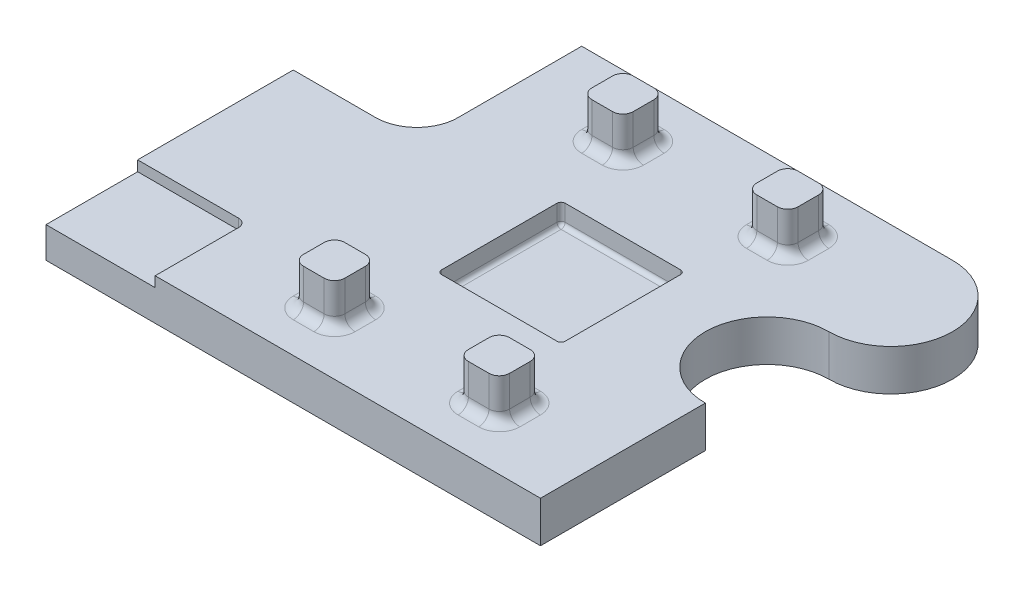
ISO-10303-21;
HEADER;
FILE_DESCRIPTION(('STEP AP214'),'2;1');
FILE_NAME('part.step','',(''),(''),'','','');
FILE_SCHEMA(('AUTOMOTIVE_DESIGN { 1 0 10303 214 1 1 1 1 }'));
ENDSEC;
DATA;
#1=APPLICATION_CONTEXT('core data for automotive mechanical design processes');
#2=APPLICATION_PROTOCOL_DEFINITION('international standard','automotive_design',2000,#1);
#3=PRODUCT_CONTEXT('',#1,'mechanical');
#4=PRODUCT('Part','Part','',(#3));
#5=PRODUCT_RELATED_PRODUCT_CATEGORY('part','',(#4));
#6=PRODUCT_DEFINITION_FORMATION('','',#4);
#7=PRODUCT_DEFINITION_CONTEXT('part definition',#1,'design');
#8=PRODUCT_DEFINITION('design','',#6,#7);
#9=PRODUCT_DEFINITION_SHAPE('','',#8);
#10=(LENGTH_UNIT() NAMED_UNIT(*) SI_UNIT(.MILLI.,.METRE.));
#11=(NAMED_UNIT(*) PLANE_ANGLE_UNIT() SI_UNIT($,.RADIAN.));
#12=(NAMED_UNIT(*) SI_UNIT($,.STERADIAN.) SOLID_ANGLE_UNIT());
#13=UNCERTAINTY_MEASURE_WITH_UNIT(LENGTH_MEASURE(1.E-05),#10,'distance_accuracy_value','');
#14=(GEOMETRIC_REPRESENTATION_CONTEXT(3) GLOBAL_UNCERTAINTY_ASSIGNED_CONTEXT((#13)) GLOBAL_UNIT_ASSIGNED_CONTEXT((#10,
#11,#12)) REPRESENTATION_CONTEXT('',''));
#15=CARTESIAN_POINT('',(0.,0.,0.));
#16=DIRECTION('',(0.,0.,1.));
#17=DIRECTION('',(1.,0.,0.));
#18=AXIS2_PLACEMENT_3D('',#15,#16,#17);
#19=CARTESIAN_POINT('',(76.2,12.7,-44.45));
#20=DIRECTION('',(0.,-1.,0.));
#21=DIRECTION('',(0.,0.,-1.));
#22=AXIS2_PLACEMENT_3D('',#19,#20,#21);
#23=PLANE('',#22);
#24=DIRECTION('',(1.,0.,0.));
#25=VECTOR('',#24,1.);
#26=CARTESIAN_POINT('',(0.,12.7,19.05));
#27=LINE('',#26,#25);
#28=CARTESIAN_POINT('',(1.27000000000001,12.7,19.05));
#29=VERTEX_POINT('',#28);
#30=CARTESIAN_POINT('',(36.83,12.7,19.05));
#31=VERTEX_POINT('',#30);
#32=EDGE_CURVE('E953',#29,#31,#27,.T.);
#33=ORIENTED_EDGE('',*,*,#32,.F.);
#34=CARTESIAN_POINT('',(1.27000000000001,12.7,17.78));
#35=DIRECTION('',(0.,-1.,0.));
#36=DIRECTION('',(0.,0.,-1.));
#37=AXIS2_PLACEMENT_3D('',#34,#35,#36);
#38=CIRCLE('',#37,1.27);
#39=CARTESIAN_POINT('',(0.,12.7,17.78));
#40=VERTEX_POINT('',#39);
#41=EDGE_CURVE('E862',#29,#40,#38,.T.);
#42=ORIENTED_EDGE('',*,*,#41,.T.);
#43=DIRECTION('',(0.,0.,1.));
#44=VECTOR('',#43,1.);
#45=CARTESIAN_POINT('',(0.,12.7,-19.05));
#46=LINE('',#45,#44);
#47=CARTESIAN_POINT('',(0.,12.7,-17.78));
#48=VERTEX_POINT('',#47);
#49=EDGE_CURVE('E949',#48,#40,#46,.T.);
#50=ORIENTED_EDGE('',*,*,#49,.F.);
#51=CARTESIAN_POINT('',(1.27,12.7,-17.78));
#52=DIRECTION('',(0.,-1.,0.));
#53=DIRECTION('',(0.,0.,-1.));
#54=AXIS2_PLACEMENT_3D('',#51,#52,#53);
#55=CIRCLE('',#54,1.27);
#56=CARTESIAN_POINT('',(1.27,12.7,-19.05));
#57=VERTEX_POINT('',#56);
#58=EDGE_CURVE('E866',#48,#57,#55,.T.);
#59=ORIENTED_EDGE('',*,*,#58,.T.);
#60=DIRECTION('',(-1.,0.,0.));
#61=VECTOR('',#60,1.);
#62=CARTESIAN_POINT('',(0.,12.7,-19.05));
#63=LINE('',#62,#61);
#64=CARTESIAN_POINT('',(36.83,12.7,-19.05));
#65=VERTEX_POINT('',#64);
#66=EDGE_CURVE('E961',#65,#57,#63,.T.);
#67=ORIENTED_EDGE('',*,*,#66,.F.);
#68=CARTESIAN_POINT('',(36.83,12.7,-17.78));
#69=DIRECTION('',(0.,-1.,0.));
#70=DIRECTION('',(0.,0.,-1.));
#71=AXIS2_PLACEMENT_3D('',#68,#69,#70);
#72=CIRCLE('',#71,1.27);
#73=CARTESIAN_POINT('',(38.1,12.7,-17.78));
#74=VERTEX_POINT('',#73);
#75=EDGE_CURVE('E868',#65,#74,#72,.T.);
#76=ORIENTED_EDGE('',*,*,#75,.T.);
#77=DIRECTION('',(0.,0.,-1.));
#78=VECTOR('',#77,1.);
#79=CARTESIAN_POINT('',(38.1,12.7,-19.05));
#80=LINE('',#79,#78);
#81=CARTESIAN_POINT('',(38.1,12.7,17.78));
#82=VERTEX_POINT('',#81);
#83=EDGE_CURVE('E957',#82,#74,#80,.T.);
#84=ORIENTED_EDGE('',*,*,#83,.F.);
#85=CARTESIAN_POINT('',(36.83,12.7,17.78));
#86=DIRECTION('',(0.,-1.,0.));
#87=DIRECTION('',(0.,0.,-1.));
#88=AXIS2_PLACEMENT_3D('',#85,#86,#87);
#89=CIRCLE('',#88,1.27);
#90=EDGE_CURVE('E864',#82,#31,#89,.T.);
#91=ORIENTED_EDGE('',*,*,#90,.T.);
#92=EDGE_LOOP('',(#33,#42,#50,#59,#67,#76,#84,#91));
#93=FACE_BOUND('',#92,.T.);
#94=CARTESIAN_POINT('',(-9.52500000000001,12.7,-47.625));
#95=DIRECTION('',(0.,-1.,0.));
#96=DIRECTION('',(0.,0.,-1.));
#97=AXIS2_PLACEMENT_3D('',#94,#95,#96);
#98=CIRCLE('',#97,6.35);
#99=CARTESIAN_POINT('',(-9.52500000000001,12.7,-53.975));
#100=VERTEX_POINT('',#99);
#101=CARTESIAN_POINT('',(-15.875,12.7,-47.625));
#102=VERTEX_POINT('',#101);
#103=EDGE_CURVE('E625',#100,#102,#98,.F.);
#104=ORIENTED_EDGE('',*,*,#103,.F.);
#105=DIRECTION('',(-1.,0.,0.));
#106=VECTOR('',#105,1.);
#107=CARTESIAN_POINT('',(0.,12.7,-53.975));
#108=LINE('',#107,#106);
#109=CARTESIAN_POINT('',(-3.17500000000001,12.7,-53.975));
#110=VERTEX_POINT('',#109);
#111=EDGE_CURVE('E621',#100,#110,#108,.F.);
#112=ORIENTED_EDGE('',*,*,#111,.T.);
#113=CARTESIAN_POINT('',(-3.17500000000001,12.7,-47.625));
#114=DIRECTION('',(0.,-1.,0.));
#115=DIRECTION('',(0.,0.,-1.));
#116=AXIS2_PLACEMENT_3D('',#113,#114,#115);
#117=CIRCLE('',#116,6.35);
#118=CARTESIAN_POINT('',(3.17499999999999,12.7,-47.625));
#119=VERTEX_POINT('',#118);
#120=EDGE_CURVE('E618',#119,#110,#117,.F.);
#121=ORIENTED_EDGE('',*,*,#120,.F.);
#122=DIRECTION('',(0.,0.,-1.));
#123=VECTOR('',#122,1.);
#124=CARTESIAN_POINT('',(3.17499999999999,12.7,-38.1));
#125=LINE('',#124,#123);
#126=CARTESIAN_POINT('',(3.17499999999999,12.7,-41.275));
#127=VERTEX_POINT('',#126);
#128=EDGE_CURVE('E613',#119,#127,#125,.F.);
#129=ORIENTED_EDGE('',*,*,#128,.T.);
#130=CARTESIAN_POINT('',(-3.17500000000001,12.7,-41.275));
#131=DIRECTION('',(0.,-1.,0.));
#132=DIRECTION('',(0.,0.,-1.));
#133=AXIS2_PLACEMENT_3D('',#130,#131,#132);
#134=CIRCLE('',#133,6.35);
#135=CARTESIAN_POINT('',(-3.17500000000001,12.7,-34.925));
#136=VERTEX_POINT('',#135);
#137=EDGE_CURVE('E609',#136,#127,#134,.F.);
#138=ORIENTED_EDGE('',*,*,#137,.F.);
#139=DIRECTION('',(1.,0.,0.));
#140=VECTOR('',#139,1.);
#141=CARTESIAN_POINT('',(-12.7,12.7,-34.925));
#142=LINE('',#141,#140);
#143=CARTESIAN_POINT('',(-9.52500000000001,12.7,-34.925));
#144=VERTEX_POINT('',#143);
#145=EDGE_CURVE('E606',#136,#144,#142,.F.);
#146=ORIENTED_EDGE('',*,*,#145,.T.);
#147=CARTESIAN_POINT('',(-9.52500000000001,12.7,-41.275));
#148=DIRECTION('',(0.,-1.,0.));
#149=DIRECTION('',(0.,0.,-1.));
#150=AXIS2_PLACEMENT_3D('',#147,#148,#149);
#151=CIRCLE('',#150,6.35);
#152=CARTESIAN_POINT('',(-15.875,12.7,-41.275));
#153=VERTEX_POINT('',#152);
#154=EDGE_CURVE('E603',#153,#144,#151,.F.);
#155=ORIENTED_EDGE('',*,*,#154,.F.);
#156=DIRECTION('',(0.,0.,1.));
#157=VECTOR('',#156,1.);
#158=CARTESIAN_POINT('',(-15.875,12.7,-50.8));
#159=LINE('',#158,#157);
#160=EDGE_CURVE('E616',#153,#102,#159,.F.);
#161=ORIENTED_EDGE('',*,*,#160,.T.);
#162=EDGE_LOOP('',(#104,#112,#121,#129,#138,#146,#155,#161));
#163=FACE_BOUND('',#162,.T.);
#164=CARTESIAN_POINT('',(41.275,12.7,-47.625));
#165=DIRECTION('',(0.,-1.,0.));
#166=DIRECTION('',(0.,0.,-1.));
#167=AXIS2_PLACEMENT_3D('',#164,#165,#166);
#168=CIRCLE('',#167,6.35);
#169=CARTESIAN_POINT('',(41.275,12.7,-53.975));
#170=VERTEX_POINT('',#169);
#171=CARTESIAN_POINT('',(34.925,12.7,-47.625));
#172=VERTEX_POINT('',#171);
#173=EDGE_CURVE('E576',#170,#172,#168,.F.);
#174=ORIENTED_EDGE('',*,*,#173,.F.);
#175=DIRECTION('',(-1.,0.,0.));
#176=VECTOR('',#175,1.);
#177=CARTESIAN_POINT('',(50.8,12.7,-53.975));
#178=LINE('',#177,#176);
#179=CARTESIAN_POINT('',(47.625,12.7,-53.975));
#180=VERTEX_POINT('',#179);
#181=EDGE_CURVE('E572',#170,#180,#178,.F.);
#182=ORIENTED_EDGE('',*,*,#181,.T.);
#183=CARTESIAN_POINT('',(47.625,12.7,-47.625));
#184=DIRECTION('',(0.,-1.,0.));
#185=DIRECTION('',(0.,0.,-1.));
#186=AXIS2_PLACEMENT_3D('',#183,#184,#185);
#187=CIRCLE('',#186,6.35);
#188=CARTESIAN_POINT('',(53.975,12.7,-47.625));
#189=VERTEX_POINT('',#188);
#190=EDGE_CURVE('E569',#189,#180,#187,.F.);
#191=ORIENTED_EDGE('',*,*,#190,.F.);
#192=DIRECTION('',(0.,0.,-1.));
#193=VECTOR('',#192,1.);
#194=CARTESIAN_POINT('',(53.975,12.7,-38.1));
#195=LINE('',#194,#193);
#196=CARTESIAN_POINT('',(53.975,12.7,-41.275));
#197=VERTEX_POINT('',#196);
#198=EDGE_CURVE('E564',#189,#197,#195,.F.);
#199=ORIENTED_EDGE('',*,*,#198,.T.);
#200=CARTESIAN_POINT('',(47.625,12.7,-41.275));
#201=DIRECTION('',(0.,-1.,0.));
#202=DIRECTION('',(0.,0.,-1.));
#203=AXIS2_PLACEMENT_3D('',#200,#201,#202);
#204=CIRCLE('',#203,6.35);
#205=CARTESIAN_POINT('',(47.625,12.7,-34.925));
#206=VERTEX_POINT('',#205);
#207=EDGE_CURVE('E561',#206,#197,#204,.F.);
#208=ORIENTED_EDGE('',*,*,#207,.F.);
#209=DIRECTION('',(1.,0.,0.));
#210=VECTOR('',#209,1.);
#211=CARTESIAN_POINT('',(38.1,12.7,-34.925));
#212=LINE('',#211,#210);
#213=CARTESIAN_POINT('',(41.275,12.7,-34.925));
#214=VERTEX_POINT('',#213);
#215=EDGE_CURVE('E558',#206,#214,#212,.F.);
#216=ORIENTED_EDGE('',*,*,#215,.T.);
#217=CARTESIAN_POINT('',(41.275,12.7,-41.275));
#218=DIRECTION('',(0.,-1.,0.));
#219=DIRECTION('',(0.,0.,-1.));
#220=AXIS2_PLACEMENT_3D('',#217,#218,#219);
#221=CIRCLE('',#220,6.35);
#222=CARTESIAN_POINT('',(34.925,12.7,-41.275));
#223=VERTEX_POINT('',#222);
#224=EDGE_CURVE('E555',#223,#214,#221,.F.);
#225=ORIENTED_EDGE('',*,*,#224,.F.);
#226=DIRECTION('',(0.,0.,1.));
#227=VECTOR('',#226,1.);
#228=CARTESIAN_POINT('',(34.925,12.7,-50.8));
#229=LINE('',#228,#227);
#230=EDGE_CURVE('E567',#223,#172,#229,.F.);
#231=ORIENTED_EDGE('',*,*,#230,.T.);
#232=EDGE_LOOP('',(#174,#182,#191,#199,#208,#216,#225,#231));
#233=FACE_BOUND('',#232,.T.);
#234=DIRECTION('',(0.,0.,1.));
#235=VECTOR('',#234,1.);
#236=CARTESIAN_POINT('',(-76.2,12.7,-63.5));
#237=LINE('',#236,#235);
#238=CARTESIAN_POINT('',(-76.2,12.7,-12.7));
#239=VERTEX_POINT('',#238);
#240=CARTESIAN_POINT('',(-76.2,12.7,35.2609582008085));
#241=VERTEX_POINT('',#240);
#242=EDGE_CURVE('E520',#239,#241,#237,.T.);
#243=ORIENTED_EDGE('',*,*,#242,.T.);
#244=DIRECTION('',(-1.,0.,0.));
#245=VECTOR('',#244,1.);
#246=CARTESIAN_POINT('',(-76.2,12.7,35.2609582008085));
#247=LINE('',#246,#245);
#248=CARTESIAN_POINT('',(-45.1026538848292,12.7,35.2609582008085));
#249=VERTEX_POINT('',#248);
#250=EDGE_CURVE('E2268',#249,#241,#247,.T.);
#251=ORIENTED_EDGE('',*,*,#250,.F.);
#252=CARTESIAN_POINT('',(-45.1026538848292,12.7,37.8009582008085));
#253=DIRECTION('',(0.,1.,0.));
#254=DIRECTION('',(0.,0.,-1.));
#255=AXIS2_PLACEMENT_3D('',#252,#253,#254);
#256=CIRCLE('',#255,2.54);
#257=CARTESIAN_POINT('',(-42.5626538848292,12.7,37.8009582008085));
#258=VERTEX_POINT('',#257);
#259=EDGE_CURVE('E512',#258,#249,#256,.T.);
#260=ORIENTED_EDGE('',*,*,#259,.F.);
#261=DIRECTION('',(0.,0.,-1.));
#262=VECTOR('',#261,1.);
#263=CARTESIAN_POINT('',(-42.5626538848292,12.7,37.8009582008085));
#264=LINE('',#263,#262);
#265=CARTESIAN_POINT('',(-42.5626538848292,12.7,63.5));
#266=VERTEX_POINT('',#265);
#267=EDGE_CURVE('E496',#266,#258,#264,.T.);
#268=ORIENTED_EDGE('',*,*,#267,.F.);
#269=DIRECTION('',(1.,0.,0.));
#270=VECTOR('',#269,1.);
#271=CARTESIAN_POINT('',(-76.2,12.7,63.5));
#272=LINE('',#271,#270);
#273=CARTESIAN_POINT('',(76.2,12.7,63.5));
#274=VERTEX_POINT('',#273);
#275=EDGE_CURVE('E508',#266,#274,#272,.T.);
#276=ORIENTED_EDGE('',*,*,#275,.T.);
#277=DIRECTION('',(0.,0.,-1.));
#278=VECTOR('',#277,1.);
#279=CARTESIAN_POINT('',(76.2,12.7,12.7));
#280=LINE('',#279,#278);
#281=CARTESIAN_POINT('',(76.2,12.7,12.7));
#282=VERTEX_POINT('',#281);
#283=EDGE_CURVE('E519',#274,#282,#280,.T.);
#284=ORIENTED_EDGE('',*,*,#283,.T.);
#285=CARTESIAN_POINT('',(76.2,12.7,-6.34999999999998));
#286=DIRECTION('',(0.,-1.,0.));
#287=DIRECTION('',(0.,0.,1.));
#288=AXIS2_PLACEMENT_3D('',#285,#286,#287);
#289=CIRCLE('',#288,19.05);
#290=CARTESIAN_POINT('',(76.2,12.7,-25.4));
#291=VERTEX_POINT('',#290);
#292=EDGE_CURVE('E524',#282,#291,#289,.T.);
#293=ORIENTED_EDGE('',*,*,#292,.T.);
#294=CARTESIAN_POINT('',(76.2,12.7,-44.45));
#295=DIRECTION('',(0.,1.,0.));
#296=DIRECTION('',(0.,0.,-1.));
#297=AXIS2_PLACEMENT_3D('',#294,#295,#296);
#298=CIRCLE('',#297,19.05);
#299=CARTESIAN_POINT('',(76.2,12.7,-63.5));
#300=VERTEX_POINT('',#299);
#301=EDGE_CURVE('E531',#291,#300,#298,.T.);
#302=ORIENTED_EDGE('',*,*,#301,.T.);
#303=DIRECTION('',(-1.,0.,0.));
#304=VECTOR('',#303,1.);
#305=CARTESIAN_POINT('',(-76.2,12.7,-63.5));
#306=LINE('',#305,#304);
#307=CARTESIAN_POINT('',(-38.1,12.7,-63.5));
#308=VERTEX_POINT('',#307);
#309=EDGE_CURVE('E526',#300,#308,#306,.T.);
#310=ORIENTED_EDGE('',*,*,#309,.T.);
#311=DIRECTION('',(0.,0.,1.));
#312=VECTOR('',#311,1.);
#313=CARTESIAN_POINT('',(-38.1,12.7,-44.45));
#314=LINE('',#313,#312);
#315=CARTESIAN_POINT('',(-38.1,12.7,-25.4));
#316=VERTEX_POINT('',#315);
#317=EDGE_CURVE('E62',#308,#316,#314,.T.);
#318=ORIENTED_EDGE('',*,*,#317,.T.);
#319=CARTESIAN_POINT('',(-50.8,12.7,-25.4));
#320=DIRECTION('',(0.,-1.,0.));
#321=DIRECTION('',(0.,0.,-1.));
#322=AXIS2_PLACEMENT_3D('',#319,#320,#321);
#323=CIRCLE('',#322,12.7);
#324=CARTESIAN_POINT('',(-50.8,12.7,-12.7));
#325=VERTEX_POINT('',#324);
#326=EDGE_CURVE('E901',#316,#325,#323,.T.);
#327=ORIENTED_EDGE('',*,*,#326,.T.);
#328=DIRECTION('',(-1.,0.,0.));
#329=VECTOR('',#328,1.);
#330=CARTESIAN_POINT('',(76.2,12.7,-12.7));
#331=LINE('',#330,#329);
#332=EDGE_CURVE('E886',#325,#239,#331,.T.);
#333=ORIENTED_EDGE('',*,*,#332,.T.);
#334=EDGE_LOOP('',(#243,#251,#260,#268,#276,#284,#293,#302,#310,#318,#327,#333));
#335=FACE_BOUND('',#334,.T.);
#336=CARTESIAN_POINT('',(41.275,12.7,47.625));
#337=DIRECTION('',(0.,-1.,0.));
#338=DIRECTION('',(0.,0.,-1.));
#339=AXIS2_PLACEMENT_3D('',#336,#337,#338);
#340=CIRCLE('',#339,6.35);
#341=CARTESIAN_POINT('',(34.925,12.7,47.625));
#342=VERTEX_POINT('',#341);
#343=CARTESIAN_POINT('',(41.275,12.7,53.975));
#344=VERTEX_POINT('',#343);
#345=EDGE_CURVE('E600',#342,#344,#340,.F.);
#346=ORIENTED_EDGE('',*,*,#345,.F.);
#347=DIRECTION('',(0.,0.,1.));
#348=VECTOR('',#347,1.);
#349=CARTESIAN_POINT('',(34.925,12.7,38.1));
#350=LINE('',#349,#348);
#351=CARTESIAN_POINT('',(34.925,12.7,41.275));
#352=VERTEX_POINT('',#351);
#353=EDGE_CURVE('E597',#342,#352,#350,.F.);
#354=ORIENTED_EDGE('',*,*,#353,.T.);
#355=CARTESIAN_POINT('',(41.275,12.7,41.275));
#356=DIRECTION('',(0.,-1.,0.));
#357=DIRECTION('',(0.,0.,-1.));
#358=AXIS2_PLACEMENT_3D('',#355,#356,#357);
#359=CIRCLE('',#358,6.35);
#360=CARTESIAN_POINT('',(41.275,12.7,34.925));
#361=VERTEX_POINT('',#360);
#362=EDGE_CURVE('E594',#361,#352,#359,.F.);
#363=ORIENTED_EDGE('',*,*,#362,.F.);
#364=DIRECTION('',(-1.,0.,0.));
#365=VECTOR('',#364,1.);
#366=CARTESIAN_POINT('',(50.8,12.7,34.925));
#367=LINE('',#366,#365);
#368=CARTESIAN_POINT('',(47.625,12.7,34.925));
#369=VERTEX_POINT('',#368);
#370=EDGE_CURVE('E589',#361,#369,#367,.F.);
#371=ORIENTED_EDGE('',*,*,#370,.T.);
#372=CARTESIAN_POINT('',(47.625,12.7,41.275));
#373=DIRECTION('',(0.,-1.,0.));
#374=DIRECTION('',(0.,0.,-1.));
#375=AXIS2_PLACEMENT_3D('',#372,#373,#374);
#376=CIRCLE('',#375,6.35);
#377=CARTESIAN_POINT('',(53.975,12.7,41.275));
#378=VERTEX_POINT('',#377);
#379=EDGE_CURVE('E586',#378,#369,#376,.F.);
#380=ORIENTED_EDGE('',*,*,#379,.F.);
#381=DIRECTION('',(0.,0.,-1.));
#382=VECTOR('',#381,1.);
#383=CARTESIAN_POINT('',(53.975,12.7,50.8));
#384=LINE('',#383,#382);
#385=CARTESIAN_POINT('',(53.975,12.7,47.625));
#386=VERTEX_POINT('',#385);
#387=EDGE_CURVE('E583',#378,#386,#384,.F.);
#388=ORIENTED_EDGE('',*,*,#387,.T.);
#389=CARTESIAN_POINT('',(47.625,12.7,47.625));
#390=DIRECTION('',(0.,-1.,0.));
#391=DIRECTION('',(0.,0.,-1.));
#392=AXIS2_PLACEMENT_3D('',#389,#390,#391);
#393=CIRCLE('',#392,6.35);
#394=CARTESIAN_POINT('',(47.625,12.7,53.975));
#395=VERTEX_POINT('',#394);
#396=EDGE_CURVE('E579',#395,#386,#393,.F.);
#397=ORIENTED_EDGE('',*,*,#396,.F.);
#398=DIRECTION('',(1.,0.,0.));
#399=VECTOR('',#398,1.);
#400=CARTESIAN_POINT('',(38.1,12.7,53.975));
#401=LINE('',#400,#399);
#402=EDGE_CURVE('E591',#395,#344,#401,.F.);
#403=ORIENTED_EDGE('',*,*,#402,.T.);
#404=EDGE_LOOP('',(#346,#354,#363,#371,#380,#388,#397,#403));
#405=FACE_BOUND('',#404,.T.);
#406=CARTESIAN_POINT('',(-9.525,12.7,41.275));
#407=DIRECTION('',(0.,-1.,0.));
#408=DIRECTION('',(0.,0.,-1.));
#409=AXIS2_PLACEMENT_3D('',#406,#407,#408);
#410=CIRCLE('',#409,6.35);
#411=CARTESIAN_POINT('',(-9.525,12.7,34.925));
#412=VERTEX_POINT('',#411);
#413=CARTESIAN_POINT('',(-15.875,12.7,41.275));
#414=VERTEX_POINT('',#413);
#415=EDGE_CURVE('E649',#412,#414,#410,.F.);
#416=ORIENTED_EDGE('',*,*,#415,.F.);
#417=DIRECTION('',(-1.,0.,0.));
#418=VECTOR('',#417,1.);
#419=CARTESIAN_POINT('',(0.,12.7,34.925));
#420=LINE('',#419,#418);
#421=CARTESIAN_POINT('',(-3.175,12.7,34.925));
#422=VERTEX_POINT('',#421);
#423=EDGE_CURVE('E646',#412,#422,#420,.F.);
#424=ORIENTED_EDGE('',*,*,#423,.T.);
#425=CARTESIAN_POINT('',(-3.175,12.7,41.275));
#426=DIRECTION('',(0.,-1.,0.));
#427=DIRECTION('',(0.,0.,-1.));
#428=AXIS2_PLACEMENT_3D('',#425,#426,#427);
#429=CIRCLE('',#428,6.35);
#430=CARTESIAN_POINT('',(3.175,12.7,41.275));
#431=VERTEX_POINT('',#430);
#432=EDGE_CURVE('E643',#431,#422,#429,.F.);
#433=ORIENTED_EDGE('',*,*,#432,.F.);
#434=DIRECTION('',(0.,0.,-1.));
#435=VECTOR('',#434,1.);
#436=CARTESIAN_POINT('',(3.175,12.7,50.8));
#437=LINE('',#436,#435);
#438=CARTESIAN_POINT('',(3.175,12.7,47.625));
#439=VERTEX_POINT('',#438);
#440=EDGE_CURVE('E638',#431,#439,#437,.F.);
#441=ORIENTED_EDGE('',*,*,#440,.T.);
#442=CARTESIAN_POINT('',(-3.175,12.7,47.625));
#443=DIRECTION('',(0.,-1.,0.));
#444=DIRECTION('',(0.,0.,-1.));
#445=AXIS2_PLACEMENT_3D('',#442,#443,#444);
#446=CIRCLE('',#445,6.35);
#447=CARTESIAN_POINT('',(-3.175,12.7,53.975));
#448=VERTEX_POINT('',#447);
#449=EDGE_CURVE('E634',#448,#439,#446,.F.);
#450=ORIENTED_EDGE('',*,*,#449,.F.);
#451=DIRECTION('',(1.,0.,0.));
#452=VECTOR('',#451,1.);
#453=CARTESIAN_POINT('',(-12.7,12.7,53.975));
#454=LINE('',#453,#452);
#455=CARTESIAN_POINT('',(-9.525,12.7,53.975));
#456=VERTEX_POINT('',#455);
#457=EDGE_CURVE('E631',#448,#456,#454,.F.);
#458=ORIENTED_EDGE('',*,*,#457,.T.);
#459=CARTESIAN_POINT('',(-9.525,12.7,47.625));
#460=DIRECTION('',(0.,-1.,0.));
#461=DIRECTION('',(0.,0.,-1.));
#462=AXIS2_PLACEMENT_3D('',#459,#460,#461);
#463=CIRCLE('',#462,6.35);
#464=CARTESIAN_POINT('',(-15.875,12.7,47.625));
#465=VERTEX_POINT('',#464);
#466=EDGE_CURVE('E628',#465,#456,#463,.F.);
#467=ORIENTED_EDGE('',*,*,#466,.F.);
#468=DIRECTION('',(0.,0.,1.));
#469=VECTOR('',#468,1.);
#470=CARTESIAN_POINT('',(-15.875,12.7,38.1));
#471=LINE('',#470,#469);
#472=EDGE_CURVE('E641',#465,#414,#471,.F.);
#473=ORIENTED_EDGE('',*,*,#472,.T.);
#474=EDGE_LOOP('',(#416,#424,#433,#441,#450,#458,#467,#473));
#475=FACE_BOUND('',#474,.T.);
#476=ADVANCED_FACE('F39',(#93,#163,#233,#335,#405,#475),#23,.F.);
#477=CARTESIAN_POINT('',(-76.2,12.7,-63.5));
#478=DIRECTION('',(0.,0.,1.));
#479=DIRECTION('',(1.,0.,0.));
#480=AXIS2_PLACEMENT_3D('',#477,#478,#479);
#481=PLANE('',#480);
#482=DIRECTION('',(-1.,0.,0.));
#483=VECTOR('',#482,1.);
#484=CARTESIAN_POINT('',(-76.2,0.,-63.5));
#485=LINE('',#484,#483);
#486=CARTESIAN_POINT('',(76.2,0.,-63.5));
#487=VERTEX_POINT('',#486);
#488=CARTESIAN_POINT('',(-38.1,0.,-63.5));
#489=VERTEX_POINT('',#488);
#490=EDGE_CURVE('E1201',#487,#489,#485,.T.);
#491=ORIENTED_EDGE('',*,*,#490,.T.);
#492=DIRECTION('',(0.,-1.,0.));
#493=VECTOR('',#492,1.);
#494=CARTESIAN_POINT('',(-38.1,281.287923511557,-63.5));
#495=LINE('',#494,#493);
#496=EDGE_CURVE('E897',#308,#489,#495,.T.);
#497=ORIENTED_EDGE('',*,*,#496,.F.);
#498=ORIENTED_EDGE('',*,*,#309,.F.);
#499=DIRECTION('',(0.,-1.,0.));
#500=VECTOR('',#499,1.);
#501=CARTESIAN_POINT('',(76.2,12.7,-63.5));
#502=LINE('',#501,#500);
#503=EDGE_CURVE('E533',#300,#487,#502,.T.);
#504=ORIENTED_EDGE('',*,*,#503,.T.);
#505=EDGE_LOOP('',(#491,#497,#498,#504));
#506=FACE_BOUND('',#505,.T.);
#507=ADVANCED_FACE('F41',(#506),#481,.F.);
#508=CARTESIAN_POINT('',(-76.2,12.7,-63.5));
#509=DIRECTION('',(1.,0.,0.));
#510=DIRECTION('',(0.,0.,-1.));
#511=AXIS2_PLACEMENT_3D('',#508,#509,#510);
#512=PLANE('',#511);
#513=DIRECTION('',(0.,0.,1.));
#514=VECTOR('',#513,1.);
#515=CARTESIAN_POINT('',(-76.2,9.525,63.5));
#516=LINE('',#515,#514);
#517=CARTESIAN_POINT('',(-76.2,9.525,35.2609582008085));
#518=VERTEX_POINT('',#517);
#519=CARTESIAN_POINT('',(-76.2,9.525,63.5));
#520=VERTEX_POINT('',#519);
#521=EDGE_CURVE('E54',#518,#520,#516,.T.);
#522=ORIENTED_EDGE('',*,*,#521,.F.);
#523=DIRECTION('',(0.,1.,0.));
#524=VECTOR('',#523,1.);
#525=CARTESIAN_POINT('',(-76.2,9.525,35.2609582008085));
#526=LINE('',#525,#524);
#527=EDGE_CURVE('E888',#518,#241,#526,.T.);
#528=ORIENTED_EDGE('',*,*,#527,.T.);
#529=ORIENTED_EDGE('',*,*,#242,.F.);
#530=DIRECTION('',(0.,-1.,0.));
#531=VECTOR('',#530,1.);
#532=CARTESIAN_POINT('',(-76.2,281.287923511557,-12.7));
#533=LINE('',#532,#531);
#534=CARTESIAN_POINT('',(-76.2,0.,-12.7));
#535=VERTEX_POINT('',#534);
#536=EDGE_CURVE('E887',#239,#535,#533,.T.);
#537=ORIENTED_EDGE('',*,*,#536,.T.);
#538=DIRECTION('',(0.,0.,1.));
#539=VECTOR('',#538,1.);
#540=CARTESIAN_POINT('',(-76.2,0.,-63.5));
#541=LINE('',#540,#539);
#542=CARTESIAN_POINT('',(-76.2,0.,63.5));
#543=VERTEX_POINT('',#542);
#544=EDGE_CURVE('E1204',#535,#543,#541,.T.);
#545=ORIENTED_EDGE('',*,*,#544,.T.);
#546=DIRECTION('',(0.,-1.,0.));
#547=VECTOR('',#546,1.);
#548=CARTESIAN_POINT('',(-76.2,12.7,63.5));
#549=LINE('',#548,#547);
#550=EDGE_CURVE('E543',#520,#543,#549,.T.);
#551=ORIENTED_EDGE('',*,*,#550,.F.);
#552=EDGE_LOOP('',(#522,#528,#529,#537,#545,#551));
#553=FACE_BOUND('',#552,.T.);
#554=ADVANCED_FACE('F1246',(#553),#512,.F.);
#555=CARTESIAN_POINT('',(-76.2,12.7,63.5));
#556=DIRECTION('',(0.,0.,-1.));
#557=DIRECTION('',(-1.,0.,0.));
#558=AXIS2_PLACEMENT_3D('',#555,#556,#557);
#559=PLANE('',#558);
#560=ORIENTED_EDGE('',*,*,#275,.F.);
#561=DIRECTION('',(0.,1.,0.));
#562=VECTOR('',#561,1.);
#563=CARTESIAN_POINT('',(-42.5626538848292,9.525,63.5));
#564=LINE('',#563,#562);
#565=CARTESIAN_POINT('',(-42.5626538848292,9.525,63.5));
#566=VERTEX_POINT('',#565);
#567=EDGE_CURVE('E493',#566,#266,#564,.T.);
#568=ORIENTED_EDGE('',*,*,#567,.F.);
#569=DIRECTION('',(1.,0.,0.));
#570=VECTOR('',#569,1.);
#571=CARTESIAN_POINT('',(-42.5626538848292,9.525,63.5));
#572=LINE('',#571,#570);
#573=EDGE_CURVE('E2267',#520,#566,#572,.T.);
#574=ORIENTED_EDGE('',*,*,#573,.F.);
#575=ORIENTED_EDGE('',*,*,#550,.T.);
#576=DIRECTION('',(1.,0.,0.));
#577=VECTOR('',#576,1.);
#578=CARTESIAN_POINT('',(-76.2,0.,63.5));
#579=LINE('',#578,#577);
#580=CARTESIAN_POINT('',(76.2,0.,63.5));
#581=VERTEX_POINT('',#580);
#582=EDGE_CURVE('E1207',#543,#581,#579,.T.);
#583=ORIENTED_EDGE('',*,*,#582,.T.);
#584=DIRECTION('',(0.,-1.,0.));
#585=VECTOR('',#584,1.);
#586=CARTESIAN_POINT('',(76.2,12.7,63.5));
#587=LINE('',#586,#585);
#588=EDGE_CURVE('E516',#274,#581,#587,.T.);
#589=ORIENTED_EDGE('',*,*,#588,.F.);
#590=EDGE_LOOP('',(#560,#568,#574,#575,#583,#589));
#591=FACE_BOUND('',#590,.T.);
#592=ADVANCED_FACE('F514',(#591),#559,.F.);
#593=CARTESIAN_POINT('',(76.2,12.7,12.7));
#594=DIRECTION('',(-1.,0.,0.));
#595=DIRECTION('',(0.,0.,1.));
#596=AXIS2_PLACEMENT_3D('',#593,#594,#595);
#597=PLANE('',#596);
#598=DIRECTION('',(0.,0.,-1.));
#599=VECTOR('',#598,1.);
#600=CARTESIAN_POINT('',(76.2,0.,12.7));
#601=LINE('',#600,#599);
#602=CARTESIAN_POINT('',(76.2,0.,12.7));
#603=VERTEX_POINT('',#602);
#604=EDGE_CURVE('E1209',#581,#603,#601,.T.);
#605=ORIENTED_EDGE('',*,*,#604,.T.);
#606=DIRECTION('',(0.,-1.,0.));
#607=VECTOR('',#606,1.);
#608=CARTESIAN_POINT('',(76.2,12.7,12.7));
#609=LINE('',#608,#607);
#610=EDGE_CURVE('E539',#282,#603,#609,.T.);
#611=ORIENTED_EDGE('',*,*,#610,.F.);
#612=ORIENTED_EDGE('',*,*,#283,.F.);
#613=ORIENTED_EDGE('',*,*,#588,.T.);
#614=EDGE_LOOP('',(#605,#611,#612,#613));
#615=FACE_BOUND('',#614,.T.);
#616=ADVANCED_FACE('F1238',(#615),#597,.F.);
#617=CARTESIAN_POINT('',(76.2,12.7,-6.34999999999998));
#618=DIRECTION('',(0.,-1.,0.));
#619=DIRECTION('',(0.,0.,-1.));
#620=AXIS2_PLACEMENT_3D('',#617,#618,#619);
#621=CYLINDRICAL_SURFACE('',#620,19.05);
#622=CARTESIAN_POINT('',(76.2,0.,-6.34999999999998));
#623=DIRECTION('',(0.,-1.,0.));
#624=DIRECTION('',(0.,0.,1.));
#625=AXIS2_PLACEMENT_3D('',#622,#623,#624);
#626=CIRCLE('',#625,19.05);
#627=CARTESIAN_POINT('',(76.2,0.,-25.4));
#628=VERTEX_POINT('',#627);
#629=EDGE_CURVE('E1212',#603,#628,#626,.T.);
#630=ORIENTED_EDGE('',*,*,#629,.T.);
#631=DIRECTION('',(0.,-1.,0.));
#632=VECTOR('',#631,1.);
#633=CARTESIAN_POINT('',(76.2,12.7,-25.4));
#634=LINE('',#633,#632);
#635=EDGE_CURVE('E536',#291,#628,#634,.T.);
#636=ORIENTED_EDGE('',*,*,#635,.F.);
#637=ORIENTED_EDGE('',*,*,#292,.F.);
#638=ORIENTED_EDGE('',*,*,#610,.T.);
#639=EDGE_LOOP('',(#630,#636,#637,#638));
#640=FACE_BOUND('',#639,.T.);
#641=ADVANCED_FACE('F1234',(#640),#621,.F.);
#642=CARTESIAN_POINT('',(76.2,12.7,-44.45));
#643=DIRECTION('',(0.,-1.,0.));
#644=DIRECTION('',(0.,0.,-1.));
#645=AXIS2_PLACEMENT_3D('',#642,#643,#644);
#646=CYLINDRICAL_SURFACE('',#645,19.05);
#647=CARTESIAN_POINT('',(76.2,0.,-44.45));
#648=DIRECTION('',(0.,1.,0.));
#649=DIRECTION('',(0.,0.,-1.));
#650=AXIS2_PLACEMENT_3D('',#647,#648,#649);
#651=CIRCLE('',#650,19.05);
#652=EDGE_CURVE('E1215',#628,#487,#651,.T.);
#653=ORIENTED_EDGE('',*,*,#652,.T.);
#654=ORIENTED_EDGE('',*,*,#503,.F.);
#655=ORIENTED_EDGE('',*,*,#301,.F.);
#656=ORIENTED_EDGE('',*,*,#635,.T.);
#657=EDGE_LOOP('',(#653,#654,#655,#656));
#658=FACE_BOUND('',#657,.T.);
#659=ADVANCED_FACE('F1228',(#658),#646,.T.);
#660=CARTESIAN_POINT('',(76.2,0.,-44.45));
#661=DIRECTION('',(0.,-1.,0.));
#662=DIRECTION('',(0.,0.,-1.));
#663=AXIS2_PLACEMENT_3D('',#660,#661,#662);
#664=PLANE('',#663);
#665=DIRECTION('',(0.,0.,1.));
#666=VECTOR('',#665,1.);
#667=CARTESIAN_POINT('',(-38.1,0.,-44.45));
#668=LINE('',#667,#666);
#669=CARTESIAN_POINT('',(-38.1,0.,-25.4));
#670=VERTEX_POINT('',#669);
#671=EDGE_CURVE('E11',#489,#670,#668,.T.);
#672=ORIENTED_EDGE('',*,*,#671,.F.);
#673=ORIENTED_EDGE('',*,*,#490,.F.);
#674=ORIENTED_EDGE('',*,*,#652,.F.);
#675=ORIENTED_EDGE('',*,*,#629,.F.);
#676=ORIENTED_EDGE('',*,*,#604,.F.);
#677=ORIENTED_EDGE('',*,*,#582,.F.);
#678=ORIENTED_EDGE('',*,*,#544,.F.);
#679=DIRECTION('',(-1.,0.,0.));
#680=VECTOR('',#679,1.);
#681=CARTESIAN_POINT('',(76.2,0.,-12.7));
#682=LINE('',#681,#680);
#683=CARTESIAN_POINT('',(-50.8,0.,-12.7));
#684=VERTEX_POINT('',#683);
#685=EDGE_CURVE('E870',#684,#535,#682,.T.);
#686=ORIENTED_EDGE('',*,*,#685,.F.);
#687=CARTESIAN_POINT('',(-50.8,0.,-25.4));
#688=DIRECTION('',(0.,-1.,0.));
#689=DIRECTION('',(0.,0.,-1.));
#690=AXIS2_PLACEMENT_3D('',#687,#688,#689);
#691=CIRCLE('',#690,12.7);
#692=EDGE_CURVE('E47',#670,#684,#691,.T.);
#693=ORIENTED_EDGE('',*,*,#692,.F.);
#694=EDGE_LOOP('',(#672,#673,#674,#675,#676,#677,#678,#686,#693));
#695=FACE_BOUND('',#694,.T.);
#696=ADVANCED_FACE('F1225',(#695),#664,.T.);
#697=CARTESIAN_POINT('',(38.1,25.4,-50.8));
#698=DIRECTION('',(1.,0.,0.));
#699=DIRECTION('',(0.,0.,-1.));
#700=AXIS2_PLACEMENT_3D('',#697,#698,#699);
#701=PLANE('',#700);
#702=DIRECTION('',(0.,0.,1.));
#703=VECTOR('',#702,1.);
#704=CARTESIAN_POINT('',(38.1,25.4,-50.8));
#705=LINE('',#704,#703);
#706=CARTESIAN_POINT('',(38.1,25.4,-47.625));
#707=VERTEX_POINT('',#706);
#708=CARTESIAN_POINT('',(38.1,25.4,-41.275));
#709=VERTEX_POINT('',#708);
#710=EDGE_CURVE('E1186',#707,#709,#705,.T.);
#711=ORIENTED_EDGE('',*,*,#710,.F.);
#712=DIRECTION('',(0.,-1.,0.));
#713=VECTOR('',#712,1.);
#714=CARTESIAN_POINT('',(38.1,25.4,-47.625));
#715=LINE('',#714,#713);
#716=CARTESIAN_POINT('',(38.1,15.875,-47.625));
#717=VERTEX_POINT('',#716);
#718=EDGE_CURVE('E740',#707,#717,#715,.T.);
#719=ORIENTED_EDGE('',*,*,#718,.T.);
#720=DIRECTION('',(0.,0.,1.));
#721=VECTOR('',#720,1.);
#722=CARTESIAN_POINT('',(38.1,15.875,-38.1));
#723=LINE('',#722,#721);
#724=CARTESIAN_POINT('',(38.1,15.875,-41.275));
#725=VERTEX_POINT('',#724);
#726=EDGE_CURVE('E737',#717,#725,#723,.T.);
#727=ORIENTED_EDGE('',*,*,#726,.T.);
#728=DIRECTION('',(0.,-1.,0.));
#729=VECTOR('',#728,1.);
#730=CARTESIAN_POINT('',(38.1,25.4,-41.275));
#731=LINE('',#730,#729);
#732=EDGE_CURVE('E734',#725,#709,#731,.F.);
#733=ORIENTED_EDGE('',*,*,#732,.T.);
#734=EDGE_LOOP('',(#711,#719,#727,#733));
#735=FACE_BOUND('',#734,.T.);
#736=ADVANCED_FACE('F1265',(#735),#701,.F.);
#737=CARTESIAN_POINT('',(38.1,25.4,-38.1));
#738=DIRECTION('',(0.,0.,-1.));
#739=DIRECTION('',(-1.,0.,0.));
#740=AXIS2_PLACEMENT_3D('',#737,#738,#739);
#741=PLANE('',#740);
#742=DIRECTION('',(1.,0.,0.));
#743=VECTOR('',#742,1.);
#744=CARTESIAN_POINT('',(50.8,15.875,-38.1));
#745=LINE('',#744,#743);
#746=CARTESIAN_POINT('',(41.275,15.875,-38.1));
#747=VERTEX_POINT('',#746);
#748=CARTESIAN_POINT('',(47.625,15.875,-38.1));
#749=VERTEX_POINT('',#748);
#750=EDGE_CURVE('E796',#747,#749,#745,.T.);
#751=ORIENTED_EDGE('',*,*,#750,.T.);
#752=DIRECTION('',(0.,-1.,0.));
#753=VECTOR('',#752,1.);
#754=CARTESIAN_POINT('',(47.625,25.4,-38.1));
#755=LINE('',#754,#753);
#756=CARTESIAN_POINT('',(47.625,25.4,-38.1));
#757=VERTEX_POINT('',#756);
#758=EDGE_CURVE('E799',#749,#757,#755,.F.);
#759=ORIENTED_EDGE('',*,*,#758,.T.);
#760=DIRECTION('',(1.,0.,0.));
#761=VECTOR('',#760,1.);
#762=CARTESIAN_POINT('',(38.1,25.4,-38.1));
#763=LINE('',#762,#761);
#764=CARTESIAN_POINT('',(41.275,25.4,-38.1));
#765=VERTEX_POINT('',#764);
#766=EDGE_CURVE('E1189',#765,#757,#763,.T.);
#767=ORIENTED_EDGE('',*,*,#766,.F.);
#768=DIRECTION('',(0.,-1.,0.));
#769=VECTOR('',#768,1.);
#770=CARTESIAN_POINT('',(41.275,25.4,-38.1));
#771=LINE('',#770,#769);
#772=EDGE_CURVE('E793',#765,#747,#771,.T.);
#773=ORIENTED_EDGE('',*,*,#772,.T.);
#774=EDGE_LOOP('',(#751,#759,#767,#773));
#775=FACE_BOUND('',#774,.T.);
#776=ADVANCED_FACE('F1269',(#775),#741,.F.);
#777=CARTESIAN_POINT('',(50.8,25.4,-50.8));
#778=DIRECTION('',(-1.,0.,0.));
#779=DIRECTION('',(0.,0.,1.));
#780=AXIS2_PLACEMENT_3D('',#777,#778,#779);
#781=PLANE('',#780);
#782=DIRECTION('',(0.,0.,-1.));
#783=VECTOR('',#782,1.);
#784=CARTESIAN_POINT('',(50.8,25.4,-50.8));
#785=LINE('',#784,#783);
#786=CARTESIAN_POINT('',(50.8,25.4,-41.275));
#787=VERTEX_POINT('',#786);
#788=CARTESIAN_POINT('',(50.8,25.4,-47.625));
#789=VERTEX_POINT('',#788);
#790=EDGE_CURVE('E1193',#787,#789,#785,.T.);
#791=ORIENTED_EDGE('',*,*,#790,.F.);
#792=DIRECTION('',(0.,-1.,0.));
#793=VECTOR('',#792,1.);
#794=CARTESIAN_POINT('',(50.8,25.4,-41.275));
#795=LINE('',#794,#793);
#796=CARTESIAN_POINT('',(50.8,15.875,-41.275));
#797=VERTEX_POINT('',#796);
#798=EDGE_CURVE('E749',#787,#797,#795,.T.);
#799=ORIENTED_EDGE('',*,*,#798,.T.);
#800=DIRECTION('',(0.,0.,-1.));
#801=VECTOR('',#800,1.);
#802=CARTESIAN_POINT('',(50.8,15.875,-50.8));
#803=LINE('',#802,#801);
#804=CARTESIAN_POINT('',(50.8,15.875,-47.625));
#805=VERTEX_POINT('',#804);
#806=EDGE_CURVE('E746',#797,#805,#803,.T.);
#807=ORIENTED_EDGE('',*,*,#806,.T.);
#808=DIRECTION('',(0.,-1.,0.));
#809=VECTOR('',#808,1.);
#810=CARTESIAN_POINT('',(50.8,25.4,-47.625));
#811=LINE('',#810,#809);
#812=EDGE_CURVE('E743',#805,#789,#811,.F.);
#813=ORIENTED_EDGE('',*,*,#812,.T.);
#814=EDGE_LOOP('',(#791,#799,#807,#813));
#815=FACE_BOUND('',#814,.T.);
#816=ADVANCED_FACE('F1274',(#815),#781,.F.);
#817=CARTESIAN_POINT('',(38.1,25.4,-50.8));
#818=DIRECTION('',(0.,0.,1.));
#819=DIRECTION('',(1.,0.,0.));
#820=AXIS2_PLACEMENT_3D('',#817,#818,#819);
#821=PLANE('',#820);
#822=DIRECTION('',(-1.,0.,0.));
#823=VECTOR('',#822,1.);
#824=CARTESIAN_POINT('',(38.1,25.4,-50.8));
#825=LINE('',#824,#823);
#826=CARTESIAN_POINT('',(47.625,25.4,-50.8));
#827=VERTEX_POINT('',#826);
#828=CARTESIAN_POINT('',(41.275,25.4,-50.8));
#829=VERTEX_POINT('',#828);
#830=EDGE_CURVE('E1197',#827,#829,#825,.T.);
#831=ORIENTED_EDGE('',*,*,#830,.F.);
#832=DIRECTION('',(0.,-1.,0.));
#833=VECTOR('',#832,1.);
#834=CARTESIAN_POINT('',(47.625,25.4,-50.8));
#835=LINE('',#834,#833);
#836=CARTESIAN_POINT('',(47.625,15.875,-50.8));
#837=VERTEX_POINT('',#836);
#838=EDGE_CURVE('E679',#827,#837,#835,.T.);
#839=ORIENTED_EDGE('',*,*,#838,.T.);
#840=DIRECTION('',(-1.,0.,0.));
#841=VECTOR('',#840,1.);
#842=CARTESIAN_POINT('',(38.1,15.875,-50.8));
#843=LINE('',#842,#841);
#844=CARTESIAN_POINT('',(41.275,15.875,-50.8));
#845=VERTEX_POINT('',#844);
#846=EDGE_CURVE('E675',#837,#845,#843,.T.);
#847=ORIENTED_EDGE('',*,*,#846,.T.);
#848=DIRECTION('',(0.,-1.,0.));
#849=VECTOR('',#848,1.);
#850=CARTESIAN_POINT('',(41.275,25.4,-50.8));
#851=LINE('',#850,#849);
#852=EDGE_CURVE('E672',#845,#829,#851,.F.);
#853=ORIENTED_EDGE('',*,*,#852,.T.);
#854=EDGE_LOOP('',(#831,#839,#847,#853));
#855=FACE_BOUND('',#854,.T.);
#856=ADVANCED_FACE('F1281',(#855),#821,.F.);
#857=CARTESIAN_POINT('',(38.1,25.4,-50.8));
#858=DIRECTION('',(0.,1.,0.));
#859=DIRECTION('',(0.,0.,1.));
#860=AXIS2_PLACEMENT_3D('',#857,#858,#859);
#861=PLANE('',#860);
#862=ORIENTED_EDGE('',*,*,#766,.T.);
#863=CARTESIAN_POINT('',(47.625,25.4,-41.275));
#864=DIRECTION('',(0.,1.,0.));
#865=DIRECTION('',(0.,0.,1.));
#866=AXIS2_PLACEMENT_3D('',#863,#864,#865);
#867=CIRCLE('',#866,3.175);
#868=EDGE_CURVE('E808',#757,#787,#867,.T.);
#869=ORIENTED_EDGE('',*,*,#868,.T.);
#870=ORIENTED_EDGE('',*,*,#790,.T.);
#871=CARTESIAN_POINT('',(47.625,25.4,-47.625));
#872=DIRECTION('',(0.,1.,0.));
#873=DIRECTION('',(0.,0.,1.));
#874=AXIS2_PLACEMENT_3D('',#871,#872,#873);
#875=CIRCLE('',#874,3.175);
#876=EDGE_CURVE('E806',#789,#827,#875,.T.);
#877=ORIENTED_EDGE('',*,*,#876,.T.);
#878=ORIENTED_EDGE('',*,*,#830,.T.);
#879=CARTESIAN_POINT('',(41.275,25.4,-47.625));
#880=DIRECTION('',(0.,1.,0.));
#881=DIRECTION('',(0.,0.,1.));
#882=AXIS2_PLACEMENT_3D('',#879,#880,#881);
#883=CIRCLE('',#882,3.175);
#884=EDGE_CURVE('E804',#829,#707,#883,.T.);
#885=ORIENTED_EDGE('',*,*,#884,.T.);
#886=ORIENTED_EDGE('',*,*,#710,.T.);
#887=CARTESIAN_POINT('',(41.275,25.4,-41.275));
#888=DIRECTION('',(0.,1.,0.));
#889=DIRECTION('',(0.,0.,1.));
#890=AXIS2_PLACEMENT_3D('',#887,#888,#889);
#891=CIRCLE('',#890,3.175);
#892=EDGE_CURVE('E802',#709,#765,#891,.T.);
#893=ORIENTED_EDGE('',*,*,#892,.T.);
#894=EDGE_LOOP('',(#862,#869,#870,#877,#878,#885,#886,#893));
#895=FACE_BOUND('',#894,.T.);
#896=ADVANCED_FACE('F1285',(#895),#861,.T.);
#897=CARTESIAN_POINT('',(38.1,25.4,38.1));
#898=DIRECTION('',(1.,0.,0.));
#899=DIRECTION('',(0.,0.,-1.));
#900=AXIS2_PLACEMENT_3D('',#897,#898,#899);
#901=PLANE('',#900);
#902=DIRECTION('',(0.,0.,1.));
#903=VECTOR('',#902,1.);
#904=CARTESIAN_POINT('',(38.1,15.875,50.8));
#905=LINE('',#904,#903);
#906=CARTESIAN_POINT('',(38.1,15.875,41.275));
#907=VERTEX_POINT('',#906);
#908=CARTESIAN_POINT('',(38.1,15.875,47.625));
#909=VERTEX_POINT('',#908);
#910=EDGE_CURVE('E665',#907,#909,#905,.T.);
#911=ORIENTED_EDGE('',*,*,#910,.T.);
#912=DIRECTION('',(0.,-1.,0.));
#913=VECTOR('',#912,1.);
#914=CARTESIAN_POINT('',(38.1,25.4,47.625));
#915=LINE('',#914,#913);
#916=CARTESIAN_POINT('',(38.1,25.4,47.625));
#917=VERTEX_POINT('',#916);
#918=EDGE_CURVE('E669',#909,#917,#915,.F.);
#919=ORIENTED_EDGE('',*,*,#918,.T.);
#920=DIRECTION('',(0.,0.,1.));
#921=VECTOR('',#920,1.);
#922=CARTESIAN_POINT('',(38.1,25.4,38.1));
#923=LINE('',#922,#921);
#924=CARTESIAN_POINT('',(38.1,25.4,41.275));
#925=VERTEX_POINT('',#924);
#926=EDGE_CURVE('E1172',#925,#917,#923,.T.);
#927=ORIENTED_EDGE('',*,*,#926,.F.);
#928=DIRECTION('',(0.,-1.,0.));
#929=VECTOR('',#928,1.);
#930=CARTESIAN_POINT('',(38.1,25.4,41.275));
#931=LINE('',#930,#929);
#932=EDGE_CURVE('E662',#925,#907,#931,.T.);
#933=ORIENTED_EDGE('',*,*,#932,.T.);
#934=EDGE_LOOP('',(#911,#919,#927,#933));
#935=FACE_BOUND('',#934,.T.);
#936=ADVANCED_FACE('F1289',(#935),#901,.F.);
#937=CARTESIAN_POINT('',(38.1,25.4,50.8));
#938=DIRECTION('',(0.,0.,-1.));
#939=DIRECTION('',(-1.,0.,0.));
#940=AXIS2_PLACEMENT_3D('',#937,#938,#939);
#941=PLANE('',#940);
#942=DIRECTION('',(1.,0.,0.));
#943=VECTOR('',#942,1.);
#944=CARTESIAN_POINT('',(38.1,25.4,50.8));
#945=LINE('',#944,#943);
#946=CARTESIAN_POINT('',(41.275,25.4,50.8));
#947=VERTEX_POINT('',#946);
#948=CARTESIAN_POINT('',(47.625,25.4,50.8));
#949=VERTEX_POINT('',#948);
#950=EDGE_CURVE('E1175',#947,#949,#945,.T.);
#951=ORIENTED_EDGE('',*,*,#950,.F.);
#952=DIRECTION('',(0.,-1.,0.));
#953=VECTOR('',#952,1.);
#954=CARTESIAN_POINT('',(41.275,25.4,50.8));
#955=LINE('',#954,#953);
#956=CARTESIAN_POINT('',(41.275,15.875,50.8));
#957=VERTEX_POINT('',#956);
#958=EDGE_CURVE('E722',#947,#957,#955,.T.);
#959=ORIENTED_EDGE('',*,*,#958,.T.);
#960=DIRECTION('',(1.,0.,0.));
#961=VECTOR('',#960,1.);
#962=CARTESIAN_POINT('',(50.8,15.875,50.8));
#963=LINE('',#962,#961);
#964=CARTESIAN_POINT('',(47.625,15.875,50.8));
#965=VERTEX_POINT('',#964);
#966=EDGE_CURVE('E719',#957,#965,#963,.T.);
#967=ORIENTED_EDGE('',*,*,#966,.T.);
#968=DIRECTION('',(0.,-1.,0.));
#969=VECTOR('',#968,1.);
#970=CARTESIAN_POINT('',(47.625,25.4,50.8));
#971=LINE('',#970,#969);
#972=EDGE_CURVE('E716',#965,#949,#971,.F.);
#973=ORIENTED_EDGE('',*,*,#972,.T.);
#974=EDGE_LOOP('',(#951,#959,#967,#973));
#975=FACE_BOUND('',#974,.T.);
#976=ADVANCED_FACE('F1293',(#975),#941,.F.);
#977=CARTESIAN_POINT('',(50.8,25.4,38.1));
#978=DIRECTION('',(-1.,0.,0.));
#979=DIRECTION('',(0.,0.,1.));
#980=AXIS2_PLACEMENT_3D('',#977,#978,#979);
#981=PLANE('',#980);
#982=DIRECTION('',(0.,0.,-1.));
#983=VECTOR('',#982,1.);
#984=CARTESIAN_POINT('',(50.8,15.875,38.1));
#985=LINE('',#984,#983);
#986=CARTESIAN_POINT('',(50.8,15.875,47.625));
#987=VERTEX_POINT('',#986);
#988=CARTESIAN_POINT('',(50.8,15.875,41.275));
#989=VERTEX_POINT('',#988);
#990=EDGE_CURVE('E787',#987,#989,#985,.T.);
#991=ORIENTED_EDGE('',*,*,#990,.T.);
#992=DIRECTION('',(0.,-1.,0.));
#993=VECTOR('',#992,1.);
#994=CARTESIAN_POINT('',(50.8,25.4,41.275));
#995=LINE('',#994,#993);
#996=CARTESIAN_POINT('',(50.8,25.4,41.275));
#997=VERTEX_POINT('',#996);
#998=EDGE_CURVE('E790',#989,#997,#995,.F.);
#999=ORIENTED_EDGE('',*,*,#998,.T.);
#1000=DIRECTION('',(0.,0.,-1.));
#1001=VECTOR('',#1000,1.);
#1002=CARTESIAN_POINT('',(50.8,25.4,38.1));
#1003=LINE('',#1002,#1001);
#1004=CARTESIAN_POINT('',(50.8,25.4,47.625));
#1005=VERTEX_POINT('',#1004);
#1006=EDGE_CURVE('E1179',#1005,#997,#1003,.T.);
#1007=ORIENTED_EDGE('',*,*,#1006,.F.);
#1008=DIRECTION('',(0.,-1.,0.));
#1009=VECTOR('',#1008,1.);
#1010=CARTESIAN_POINT('',(50.8,25.4,47.625));
#1011=LINE('',#1010,#1009);
#1012=EDGE_CURVE('E785',#1005,#987,#1011,.T.);
#1013=ORIENTED_EDGE('',*,*,#1012,.T.);
#1014=EDGE_LOOP('',(#991,#999,#1007,#1013));
#1015=FACE_BOUND('',#1014,.T.);
#1016=ADVANCED_FACE('F1297',(#1015),#981,.F.);
#1017=CARTESIAN_POINT('',(38.1,25.4,38.1));
#1018=DIRECTION('',(0.,0.,1.));
#1019=DIRECTION('',(1.,0.,0.));
#1020=AXIS2_PLACEMENT_3D('',#1017,#1018,#1019);
#1021=PLANE('',#1020);
#1022=DIRECTION('',(-1.,0.,0.));
#1023=VECTOR('',#1022,1.);
#1024=CARTESIAN_POINT('',(38.1,15.875,38.1));
#1025=LINE('',#1024,#1023);
#1026=CARTESIAN_POINT('',(47.625,15.875,38.1));
#1027=VERTEX_POINT('',#1026);
#1028=CARTESIAN_POINT('',(41.275,15.875,38.1));
#1029=VERTEX_POINT('',#1028);
#1030=EDGE_CURVE('E728',#1027,#1029,#1025,.T.);
#1031=ORIENTED_EDGE('',*,*,#1030,.T.);
#1032=DIRECTION('',(0.,-1.,0.));
#1033=VECTOR('',#1032,1.);
#1034=CARTESIAN_POINT('',(41.275,25.4,38.1));
#1035=LINE('',#1034,#1033);
#1036=CARTESIAN_POINT('',(41.275,25.4,38.1));
#1037=VERTEX_POINT('',#1036);
#1038=EDGE_CURVE('E731',#1029,#1037,#1035,.F.);
#1039=ORIENTED_EDGE('',*,*,#1038,.T.);
#1040=DIRECTION('',(-1.,0.,0.));
#1041=VECTOR('',#1040,1.);
#1042=CARTESIAN_POINT('',(38.1,25.4,38.1));
#1043=LINE('',#1042,#1041);
#1044=CARTESIAN_POINT('',(47.625,25.4,38.1));
#1045=VERTEX_POINT('',#1044);
#1046=EDGE_CURVE('E1183',#1045,#1037,#1043,.T.);
#1047=ORIENTED_EDGE('',*,*,#1046,.F.);
#1048=DIRECTION('',(0.,-1.,0.));
#1049=VECTOR('',#1048,1.);
#1050=CARTESIAN_POINT('',(47.625,25.4,38.1));
#1051=LINE('',#1050,#1049);
#1052=EDGE_CURVE('E725',#1045,#1027,#1051,.T.);
#1053=ORIENTED_EDGE('',*,*,#1052,.T.);
#1054=EDGE_LOOP('',(#1031,#1039,#1047,#1053));
#1055=FACE_BOUND('',#1054,.T.);
#1056=ADVANCED_FACE('F1301',(#1055),#1021,.F.);
#1057=CARTESIAN_POINT('',(38.1,25.4,50.8));
#1058=DIRECTION('',(0.,1.,0.));
#1059=DIRECTION('',(0.,0.,1.));
#1060=AXIS2_PLACEMENT_3D('',#1057,#1058,#1059);
#1061=PLANE('',#1060);
#1062=ORIENTED_EDGE('',*,*,#926,.T.);
#1063=CARTESIAN_POINT('',(41.275,25.4,47.625));
#1064=DIRECTION('',(0.,1.,0.));
#1065=DIRECTION('',(0.,0.,1.));
#1066=AXIS2_PLACEMENT_3D('',#1063,#1064,#1065);
#1067=CIRCLE('',#1066,3.175);
#1068=EDGE_CURVE('E816',#917,#947,#1067,.T.);
#1069=ORIENTED_EDGE('',*,*,#1068,.T.);
#1070=ORIENTED_EDGE('',*,*,#950,.T.);
#1071=CARTESIAN_POINT('',(47.625,25.4,47.625));
#1072=DIRECTION('',(0.,1.,0.));
#1073=DIRECTION('',(0.,0.,1.));
#1074=AXIS2_PLACEMENT_3D('',#1071,#1072,#1073);
#1075=CIRCLE('',#1074,3.175);
#1076=EDGE_CURVE('E810',#949,#1005,#1075,.T.);
#1077=ORIENTED_EDGE('',*,*,#1076,.T.);
#1078=ORIENTED_EDGE('',*,*,#1006,.T.);
#1079=CARTESIAN_POINT('',(47.625,25.4,41.275));
#1080=DIRECTION('',(0.,1.,0.));
#1081=DIRECTION('',(0.,0.,1.));
#1082=AXIS2_PLACEMENT_3D('',#1079,#1080,#1081);
#1083=CIRCLE('',#1082,3.175);
#1084=EDGE_CURVE('E812',#997,#1045,#1083,.T.);
#1085=ORIENTED_EDGE('',*,*,#1084,.T.);
#1086=ORIENTED_EDGE('',*,*,#1046,.T.);
#1087=CARTESIAN_POINT('',(41.275,25.4,41.275));
#1088=DIRECTION('',(0.,1.,0.));
#1089=DIRECTION('',(0.,0.,1.));
#1090=AXIS2_PLACEMENT_3D('',#1087,#1088,#1089);
#1091=CIRCLE('',#1090,3.175);
#1092=EDGE_CURVE('E814',#1037,#925,#1091,.T.);
#1093=ORIENTED_EDGE('',*,*,#1092,.T.);
#1094=EDGE_LOOP('',(#1062,#1069,#1070,#1077,#1078,#1085,#1086,#1093));
#1095=FACE_BOUND('',#1094,.T.);
#1096=ADVANCED_FACE('F1305',(#1095),#1061,.T.);
#1097=CARTESIAN_POINT('',(0.,25.4,50.8));
#1098=DIRECTION('',(-1.,0.,0.));
#1099=DIRECTION('',(0.,0.,1.));
#1100=AXIS2_PLACEMENT_3D('',#1097,#1098,#1099);
#1101=PLANE('',#1100);
#1102=DIRECTION('',(0.,0.,-1.));
#1103=VECTOR('',#1102,1.);
#1104=CARTESIAN_POINT('',(0.,25.4,50.8));
#1105=LINE('',#1104,#1103);
#1106=CARTESIAN_POINT('',(0.,25.4,47.625));
#1107=VERTEX_POINT('',#1106);
#1108=CARTESIAN_POINT('',(0.,25.4,41.275));
#1109=VERTEX_POINT('',#1108);
#1110=EDGE_CURVE('E1158',#1107,#1109,#1105,.T.);
#1111=ORIENTED_EDGE('',*,*,#1110,.F.);
#1112=DIRECTION('',(0.,-1.,0.));
#1113=VECTOR('',#1112,1.);
#1114=CARTESIAN_POINT('',(0.,25.4,47.625));
#1115=LINE('',#1114,#1113);
#1116=CARTESIAN_POINT('',(0.,15.875,47.625));
#1117=VERTEX_POINT('',#1116);
#1118=EDGE_CURVE('E697',#1107,#1117,#1115,.T.);
#1119=ORIENTED_EDGE('',*,*,#1118,.T.);
#1120=DIRECTION('',(0.,0.,-1.));
#1121=VECTOR('',#1120,1.);
#1122=CARTESIAN_POINT('',(0.,15.875,38.1));
#1123=LINE('',#1122,#1121);
#1124=CARTESIAN_POINT('',(0.,15.875,41.275));
#1125=VERTEX_POINT('',#1124);
#1126=EDGE_CURVE('E694',#1117,#1125,#1123,.T.);
#1127=ORIENTED_EDGE('',*,*,#1126,.T.);
#1128=DIRECTION('',(0.,-1.,0.));
#1129=VECTOR('',#1128,1.);
#1130=CARTESIAN_POINT('',(0.,25.4,41.275));
#1131=LINE('',#1130,#1129);
#1132=EDGE_CURVE('E691',#1125,#1109,#1131,.F.);
#1133=ORIENTED_EDGE('',*,*,#1132,.T.);
#1134=EDGE_LOOP('',(#1111,#1119,#1127,#1133));
#1135=FACE_BOUND('',#1134,.T.);
#1136=ADVANCED_FACE('F1308',(#1135),#1101,.F.);
#1137=CARTESIAN_POINT('',(0.,25.4,38.1));
#1138=DIRECTION('',(0.,0.,1.));
#1139=DIRECTION('',(1.,0.,0.));
#1140=AXIS2_PLACEMENT_3D('',#1137,#1138,#1139);
#1141=PLANE('',#1140);
#1142=DIRECTION('',(-1.,0.,0.));
#1143=VECTOR('',#1142,1.);
#1144=CARTESIAN_POINT('',(0.,25.4,38.1));
#1145=LINE('',#1144,#1143);
#1146=CARTESIAN_POINT('',(-3.175,25.4,38.1));
#1147=VERTEX_POINT('',#1146);
#1148=CARTESIAN_POINT('',(-9.525,25.4,38.1));
#1149=VERTEX_POINT('',#1148);
#1150=EDGE_CURVE('E1162',#1147,#1149,#1145,.T.);
#1151=ORIENTED_EDGE('',*,*,#1150,.F.);
#1152=DIRECTION('',(0.,-1.,0.));
#1153=VECTOR('',#1152,1.);
#1154=CARTESIAN_POINT('',(-3.175,25.4,38.1));
#1155=LINE('',#1154,#1153);
#1156=CARTESIAN_POINT('',(-3.175,15.875,38.1));
#1157=VERTEX_POINT('',#1156);
#1158=EDGE_CURVE('E552',#1147,#1157,#1155,.T.);
#1159=ORIENTED_EDGE('',*,*,#1158,.T.);
#1160=DIRECTION('',(-1.,0.,0.));
#1161=VECTOR('',#1160,1.);
#1162=CARTESIAN_POINT('',(-12.7,15.875,38.1));
#1163=LINE('',#1162,#1161);
#1164=CARTESIAN_POINT('',(-9.525,15.875,38.1));
#1165=VERTEX_POINT('',#1164);
#1166=EDGE_CURVE('E548',#1157,#1165,#1163,.T.);
#1167=ORIENTED_EDGE('',*,*,#1166,.T.);
#1168=DIRECTION('',(0.,-1.,0.));
#1169=VECTOR('',#1168,1.);
#1170=CARTESIAN_POINT('',(-9.525,25.4,38.1));
#1171=LINE('',#1170,#1169);
#1172=EDGE_CURVE('E545',#1165,#1149,#1171,.F.);
#1173=ORIENTED_EDGE('',*,*,#1172,.T.);
#1174=EDGE_LOOP('',(#1151,#1159,#1167,#1173));
#1175=FACE_BOUND('',#1174,.T.);
#1176=ADVANCED_FACE('F1312',(#1175),#1141,.F.);
#1177=CARTESIAN_POINT('',(-12.7,25.4,50.8));
#1178=DIRECTION('',(1.,0.,0.));
#1179=DIRECTION('',(0.,0.,-1.));
#1180=AXIS2_PLACEMENT_3D('',#1177,#1178,#1179);
#1181=PLANE('',#1180);
#1182=DIRECTION('',(0.,0.,1.));
#1183=VECTOR('',#1182,1.);
#1184=CARTESIAN_POINT('',(-12.7,15.875,50.8));
#1185=LINE('',#1184,#1183);
#1186=CARTESIAN_POINT('',(-12.7,15.875,41.275));
#1187=VERTEX_POINT('',#1186);
#1188=CARTESIAN_POINT('',(-12.7,15.875,47.625));
#1189=VERTEX_POINT('',#1188);
#1190=EDGE_CURVE('E685',#1187,#1189,#1185,.T.);
#1191=ORIENTED_EDGE('',*,*,#1190,.T.);
#1192=DIRECTION('',(0.,-1.,0.));
#1193=VECTOR('',#1192,1.);
#1194=CARTESIAN_POINT('',(-12.7,25.4,47.625));
#1195=LINE('',#1194,#1193);
#1196=CARTESIAN_POINT('',(-12.7,25.4,47.625));
#1197=VERTEX_POINT('',#1196);
#1198=EDGE_CURVE('E688',#1189,#1197,#1195,.F.);
#1199=ORIENTED_EDGE('',*,*,#1198,.T.);
#1200=DIRECTION('',(0.,0.,1.));
#1201=VECTOR('',#1200,1.);
#1202=CARTESIAN_POINT('',(-12.7,25.4,50.8));
#1203=LINE('',#1202,#1201);
#1204=CARTESIAN_POINT('',(-12.7,25.4,41.275));
#1205=VERTEX_POINT('',#1204);
#1206=EDGE_CURVE('E1165',#1205,#1197,#1203,.T.);
#1207=ORIENTED_EDGE('',*,*,#1206,.F.);
#1208=DIRECTION('',(0.,-1.,0.));
#1209=VECTOR('',#1208,1.);
#1210=CARTESIAN_POINT('',(-12.7,25.4,41.275));
#1211=LINE('',#1210,#1209);
#1212=EDGE_CURVE('E682',#1205,#1187,#1211,.T.);
#1213=ORIENTED_EDGE('',*,*,#1212,.T.);
#1214=EDGE_LOOP('',(#1191,#1199,#1207,#1213));
#1215=FACE_BOUND('',#1214,.T.);
#1216=ADVANCED_FACE('F1316',(#1215),#1181,.F.);
#1217=CARTESIAN_POINT('',(0.,25.4,50.8));
#1218=DIRECTION('',(0.,0.,-1.));
#1219=DIRECTION('',(-1.,0.,0.));
#1220=AXIS2_PLACEMENT_3D('',#1217,#1218,#1219);
#1221=PLANE('',#1220);
#1222=DIRECTION('',(1.,0.,0.));
#1223=VECTOR('',#1222,1.);
#1224=CARTESIAN_POINT('',(0.,25.4,50.8));
#1225=LINE('',#1224,#1223);
#1226=CARTESIAN_POINT('',(-9.525,25.4,50.8));
#1227=VERTEX_POINT('',#1226);
#1228=CARTESIAN_POINT('',(-3.175,25.4,50.8));
#1229=VERTEX_POINT('',#1228);
#1230=EDGE_CURVE('E1168',#1227,#1229,#1225,.T.);
#1231=ORIENTED_EDGE('',*,*,#1230,.F.);
#1232=DIRECTION('',(0.,-1.,0.));
#1233=VECTOR('',#1232,1.);
#1234=CARTESIAN_POINT('',(-9.525,25.4,50.8));
#1235=LINE('',#1234,#1233);
#1236=CARTESIAN_POINT('',(-9.525,15.875,50.8));
#1237=VERTEX_POINT('',#1236);
#1238=EDGE_CURVE('E757',#1227,#1237,#1235,.T.);
#1239=ORIENTED_EDGE('',*,*,#1238,.T.);
#1240=DIRECTION('',(1.,0.,0.));
#1241=VECTOR('',#1240,1.);
#1242=CARTESIAN_POINT('',(0.,15.875,50.8));
#1243=LINE('',#1242,#1241);
#1244=CARTESIAN_POINT('',(-3.175,15.875,50.8));
#1245=VERTEX_POINT('',#1244);
#1246=EDGE_CURVE('E754',#1237,#1245,#1243,.T.);
#1247=ORIENTED_EDGE('',*,*,#1246,.T.);
#1248=DIRECTION('',(0.,-1.,0.));
#1249=VECTOR('',#1248,1.);
#1250=CARTESIAN_POINT('',(-3.175,25.4,50.8));
#1251=LINE('',#1250,#1249);
#1252=EDGE_CURVE('E751',#1245,#1229,#1251,.F.);
#1253=ORIENTED_EDGE('',*,*,#1252,.T.);
#1254=EDGE_LOOP('',(#1231,#1239,#1247,#1253));
#1255=FACE_BOUND('',#1254,.T.);
#1256=ADVANCED_FACE('F1320',(#1255),#1221,.F.);
#1257=CARTESIAN_POINT('',(0.,25.4,50.8));
#1258=DIRECTION('',(0.,1.,0.));
#1259=DIRECTION('',(0.,0.,1.));
#1260=AXIS2_PLACEMENT_3D('',#1257,#1258,#1259);
#1261=PLANE('',#1260);
#1262=ORIENTED_EDGE('',*,*,#1206,.T.);
#1263=CARTESIAN_POINT('',(-9.525,25.4,47.625));
#1264=DIRECTION('',(0.,1.,0.));
#1265=DIRECTION('',(0.,0.,1.));
#1266=AXIS2_PLACEMENT_3D('',#1263,#1264,#1265);
#1267=CIRCLE('',#1266,3.175);
#1268=EDGE_CURVE('E766',#1197,#1227,#1267,.T.);
#1269=ORIENTED_EDGE('',*,*,#1268,.T.);
#1270=ORIENTED_EDGE('',*,*,#1230,.T.);
#1271=CARTESIAN_POINT('',(-3.175,25.4,47.625));
#1272=DIRECTION('',(0.,1.,0.));
#1273=DIRECTION('',(0.,0.,1.));
#1274=AXIS2_PLACEMENT_3D('',#1271,#1272,#1273);
#1275=CIRCLE('',#1274,3.175);
#1276=EDGE_CURVE('E764',#1229,#1107,#1275,.T.);
#1277=ORIENTED_EDGE('',*,*,#1276,.T.);
#1278=ORIENTED_EDGE('',*,*,#1110,.T.);
#1279=CARTESIAN_POINT('',(-3.175,25.4,41.275));
#1280=DIRECTION('',(0.,1.,0.));
#1281=DIRECTION('',(0.,0.,1.));
#1282=AXIS2_PLACEMENT_3D('',#1279,#1280,#1281);
#1283=CIRCLE('',#1282,3.175);
#1284=EDGE_CURVE('E762',#1109,#1147,#1283,.T.);
#1285=ORIENTED_EDGE('',*,*,#1284,.T.);
#1286=ORIENTED_EDGE('',*,*,#1150,.T.);
#1287=CARTESIAN_POINT('',(-9.525,25.4,41.275));
#1288=DIRECTION('',(0.,1.,0.));
#1289=DIRECTION('',(0.,0.,1.));
#1290=AXIS2_PLACEMENT_3D('',#1287,#1288,#1289);
#1291=CIRCLE('',#1290,3.175);
#1292=EDGE_CURVE('E760',#1149,#1205,#1291,.T.);
#1293=ORIENTED_EDGE('',*,*,#1292,.T.);
#1294=EDGE_LOOP('',(#1262,#1269,#1270,#1277,#1278,#1285,#1286,#1293));
#1295=FACE_BOUND('',#1294,.T.);
#1296=ADVANCED_FACE('F1324',(#1295),#1261,.T.);
#1297=CARTESIAN_POINT('',(0.,25.4,-38.1));
#1298=DIRECTION('',(-1.,0.,0.));
#1299=DIRECTION('',(0.,0.,1.));
#1300=AXIS2_PLACEMENT_3D('',#1297,#1298,#1299);
#1301=PLANE('',#1300);
#1302=DIRECTION('',(0.,0.,-1.));
#1303=VECTOR('',#1302,1.);
#1304=CARTESIAN_POINT('',(0.,25.4,-38.1));
#1305=LINE('',#1304,#1303);
#1306=CARTESIAN_POINT('',(0.,25.4,-41.275));
#1307=VERTEX_POINT('',#1306);
#1308=CARTESIAN_POINT('',(0.,25.4,-47.625));
#1309=VERTEX_POINT('',#1308);
#1310=EDGE_CURVE('E1144',#1307,#1309,#1305,.T.);
#1311=ORIENTED_EDGE('',*,*,#1310,.F.);
#1312=DIRECTION('',(0.,-1.,0.));
#1313=VECTOR('',#1312,1.);
#1314=CARTESIAN_POINT('',(0.,25.4,-41.275));
#1315=LINE('',#1314,#1313);
#1316=CARTESIAN_POINT('',(0.,15.875,-41.275));
#1317=VERTEX_POINT('',#1316);
#1318=EDGE_CURVE('E714',#1307,#1317,#1315,.T.);
#1319=ORIENTED_EDGE('',*,*,#1318,.T.);
#1320=DIRECTION('',(0.,0.,-1.));
#1321=VECTOR('',#1320,1.);
#1322=CARTESIAN_POINT('',(0.,15.875,-50.8));
#1323=LINE('',#1322,#1321);
#1324=CARTESIAN_POINT('',(0.,15.875,-47.625));
#1325=VERTEX_POINT('',#1324);
#1326=EDGE_CURVE('E711',#1317,#1325,#1323,.T.);
#1327=ORIENTED_EDGE('',*,*,#1326,.T.);
#1328=DIRECTION('',(0.,-1.,0.));
#1329=VECTOR('',#1328,1.);
#1330=CARTESIAN_POINT('',(0.,25.4,-47.625));
#1331=LINE('',#1330,#1329);
#1332=EDGE_CURVE('E708',#1325,#1309,#1331,.F.);
#1333=ORIENTED_EDGE('',*,*,#1332,.T.);
#1334=EDGE_LOOP('',(#1311,#1319,#1327,#1333));
#1335=FACE_BOUND('',#1334,.T.);
#1336=ADVANCED_FACE('F1328',(#1335),#1301,.F.);
#1337=CARTESIAN_POINT('',(0.,25.4,-50.8));
#1338=DIRECTION('',(0.,0.,1.));
#1339=DIRECTION('',(1.,0.,0.));
#1340=AXIS2_PLACEMENT_3D('',#1337,#1338,#1339);
#1341=PLANE('',#1340);
#1342=DIRECTION('',(-1.,0.,0.));
#1343=VECTOR('',#1342,1.);
#1344=CARTESIAN_POINT('',(0.,25.4,-50.8));
#1345=LINE('',#1344,#1343);
#1346=CARTESIAN_POINT('',(-3.17500000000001,25.4,-50.8));
#1347=VERTEX_POINT('',#1346);
#1348=CARTESIAN_POINT('',(-9.52500000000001,25.4,-50.8));
#1349=VERTEX_POINT('',#1348);
#1350=EDGE_CURVE('E1148',#1347,#1349,#1345,.T.);
#1351=ORIENTED_EDGE('',*,*,#1350,.F.);
#1352=DIRECTION('',(0.,-1.,0.));
#1353=VECTOR('',#1352,1.);
#1354=CARTESIAN_POINT('',(-3.17500000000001,25.4,-50.8));
#1355=LINE('',#1354,#1353);
#1356=CARTESIAN_POINT('',(-3.17500000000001,15.875,-50.8));
#1357=VERTEX_POINT('',#1356);
#1358=EDGE_CURVE('E659',#1347,#1357,#1355,.T.);
#1359=ORIENTED_EDGE('',*,*,#1358,.T.);
#1360=DIRECTION('',(-1.,0.,0.));
#1361=VECTOR('',#1360,1.);
#1362=CARTESIAN_POINT('',(-12.7,15.875,-50.8));
#1363=LINE('',#1362,#1361);
#1364=CARTESIAN_POINT('',(-9.52500000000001,15.875,-50.8));
#1365=VERTEX_POINT('',#1364);
#1366=EDGE_CURVE('E655',#1357,#1365,#1363,.T.);
#1367=ORIENTED_EDGE('',*,*,#1366,.T.);
#1368=DIRECTION('',(0.,-1.,0.));
#1369=VECTOR('',#1368,1.);
#1370=CARTESIAN_POINT('',(-9.52500000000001,25.4,-50.8));
#1371=LINE('',#1370,#1369);
#1372=EDGE_CURVE('E652',#1365,#1349,#1371,.F.);
#1373=ORIENTED_EDGE('',*,*,#1372,.T.);
#1374=EDGE_LOOP('',(#1351,#1359,#1367,#1373));
#1375=FACE_BOUND('',#1374,.T.);
#1376=ADVANCED_FACE('F1332',(#1375),#1341,.F.);
#1377=CARTESIAN_POINT('',(-12.7,25.4,-38.1));
#1378=DIRECTION('',(1.,0.,0.));
#1379=DIRECTION('',(0.,0.,-1.));
#1380=AXIS2_PLACEMENT_3D('',#1377,#1378,#1379);
#1381=PLANE('',#1380);
#1382=DIRECTION('',(0.,0.,1.));
#1383=VECTOR('',#1382,1.);
#1384=CARTESIAN_POINT('',(-12.7,15.875,-38.1));
#1385=LINE('',#1384,#1383);
#1386=CARTESIAN_POINT('',(-12.7,15.875,-47.625));
#1387=VERTEX_POINT('',#1386);
#1388=CARTESIAN_POINT('',(-12.7,15.875,-41.275));
#1389=VERTEX_POINT('',#1388);
#1390=EDGE_CURVE('E702',#1387,#1389,#1385,.T.);
#1391=ORIENTED_EDGE('',*,*,#1390,.T.);
#1392=DIRECTION('',(0.,-1.,0.));
#1393=VECTOR('',#1392,1.);
#1394=CARTESIAN_POINT('',(-12.7,25.4,-41.275));
#1395=LINE('',#1394,#1393);
#1396=CARTESIAN_POINT('',(-12.7,25.4,-41.275));
#1397=VERTEX_POINT('',#1396);
#1398=EDGE_CURVE('E705',#1389,#1397,#1395,.F.);
#1399=ORIENTED_EDGE('',*,*,#1398,.T.);
#1400=DIRECTION('',(0.,0.,1.));
#1401=VECTOR('',#1400,1.);
#1402=CARTESIAN_POINT('',(-12.7,25.4,-38.1));
#1403=LINE('',#1402,#1401);
#1404=CARTESIAN_POINT('',(-12.7,25.4,-47.625));
#1405=VERTEX_POINT('',#1404);
#1406=EDGE_CURVE('E1151',#1405,#1397,#1403,.T.);
#1407=ORIENTED_EDGE('',*,*,#1406,.F.);
#1408=DIRECTION('',(0.,-1.,0.));
#1409=VECTOR('',#1408,1.);
#1410=CARTESIAN_POINT('',(-12.7,25.4,-47.625));
#1411=LINE('',#1410,#1409);
#1412=EDGE_CURVE('E699',#1405,#1387,#1411,.T.);
#1413=ORIENTED_EDGE('',*,*,#1412,.T.);
#1414=EDGE_LOOP('',(#1391,#1399,#1407,#1413));
#1415=FACE_BOUND('',#1414,.T.);
#1416=ADVANCED_FACE('F1336',(#1415),#1381,.F.);
#1417=CARTESIAN_POINT('',(0.,25.4,-38.1));
#1418=DIRECTION('',(0.,0.,-1.));
#1419=DIRECTION('',(-1.,0.,0.));
#1420=AXIS2_PLACEMENT_3D('',#1417,#1418,#1419);
#1421=PLANE('',#1420);
#1422=DIRECTION('',(1.,0.,0.));
#1423=VECTOR('',#1422,1.);
#1424=CARTESIAN_POINT('',(0.,15.875,-38.1));
#1425=LINE('',#1424,#1423);
#1426=CARTESIAN_POINT('',(-9.52500000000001,15.875,-38.1));
#1427=VERTEX_POINT('',#1426);
#1428=CARTESIAN_POINT('',(-3.17500000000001,15.875,-38.1));
#1429=VERTEX_POINT('',#1428);
#1430=EDGE_CURVE('E771',#1427,#1429,#1425,.T.);
#1431=ORIENTED_EDGE('',*,*,#1430,.T.);
#1432=DIRECTION('',(0.,-1.,0.));
#1433=VECTOR('',#1432,1.);
#1434=CARTESIAN_POINT('',(-3.17500000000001,25.4,-38.1));
#1435=LINE('',#1434,#1433);
#1436=CARTESIAN_POINT('',(-3.17500000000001,25.4,-38.1));
#1437=VERTEX_POINT('',#1436);
#1438=EDGE_CURVE('E774',#1429,#1437,#1435,.F.);
#1439=ORIENTED_EDGE('',*,*,#1438,.T.);
#1440=DIRECTION('',(1.,0.,0.));
#1441=VECTOR('',#1440,1.);
#1442=CARTESIAN_POINT('',(0.,25.4,-38.1));
#1443=LINE('',#1442,#1441);
#1444=CARTESIAN_POINT('',(-9.52500000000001,25.4,-38.1));
#1445=VERTEX_POINT('',#1444);
#1446=EDGE_CURVE('E1154',#1445,#1437,#1443,.T.);
#1447=ORIENTED_EDGE('',*,*,#1446,.F.);
#1448=DIRECTION('',(0.,-1.,0.));
#1449=VECTOR('',#1448,1.);
#1450=CARTESIAN_POINT('',(-9.52500000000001,25.4,-38.1));
#1451=LINE('',#1450,#1449);
#1452=EDGE_CURVE('E768',#1445,#1427,#1451,.T.);
#1453=ORIENTED_EDGE('',*,*,#1452,.T.);
#1454=EDGE_LOOP('',(#1431,#1439,#1447,#1453));
#1455=FACE_BOUND('',#1454,.T.);
#1456=ADVANCED_FACE('F1340',(#1455),#1421,.F.);
#1457=CARTESIAN_POINT('',(0.,25.4,-50.8));
#1458=DIRECTION('',(0.,1.,0.));
#1459=DIRECTION('',(0.,0.,1.));
#1460=AXIS2_PLACEMENT_3D('',#1457,#1458,#1459);
#1461=PLANE('',#1460);
#1462=ORIENTED_EDGE('',*,*,#1446,.T.);
#1463=CARTESIAN_POINT('',(-3.17500000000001,25.4,-41.275));
#1464=DIRECTION('',(0.,1.,0.));
#1465=DIRECTION('',(0.,0.,1.));
#1466=AXIS2_PLACEMENT_3D('',#1463,#1464,#1465);
#1467=CIRCLE('',#1466,3.175);
#1468=EDGE_CURVE('E783',#1437,#1307,#1467,.T.);
#1469=ORIENTED_EDGE('',*,*,#1468,.T.);
#1470=ORIENTED_EDGE('',*,*,#1310,.T.);
#1471=CARTESIAN_POINT('',(-3.17500000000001,25.4,-47.625));
#1472=DIRECTION('',(0.,1.,0.));
#1473=DIRECTION('',(0.,0.,1.));
#1474=AXIS2_PLACEMENT_3D('',#1471,#1472,#1473);
#1475=CIRCLE('',#1474,3.175);
#1476=EDGE_CURVE('E779',#1309,#1347,#1475,.T.);
#1477=ORIENTED_EDGE('',*,*,#1476,.T.);
#1478=ORIENTED_EDGE('',*,*,#1350,.T.);
#1479=CARTESIAN_POINT('',(-9.52500000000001,25.4,-47.625));
#1480=DIRECTION('',(0.,1.,0.));
#1481=DIRECTION('',(0.,0.,1.));
#1482=AXIS2_PLACEMENT_3D('',#1479,#1480,#1481);
#1483=CIRCLE('',#1482,3.175);
#1484=EDGE_CURVE('E777',#1349,#1405,#1483,.T.);
#1485=ORIENTED_EDGE('',*,*,#1484,.T.);
#1486=ORIENTED_EDGE('',*,*,#1406,.T.);
#1487=CARTESIAN_POINT('',(-9.52500000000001,25.4,-41.275));
#1488=DIRECTION('',(0.,1.,0.));
#1489=DIRECTION('',(0.,0.,1.));
#1490=AXIS2_PLACEMENT_3D('',#1487,#1488,#1489);
#1491=CIRCLE('',#1490,3.175);
#1492=EDGE_CURVE('E781',#1397,#1445,#1491,.T.);
#1493=ORIENTED_EDGE('',*,*,#1492,.T.);
#1494=EDGE_LOOP('',(#1462,#1469,#1470,#1477,#1478,#1485,#1486,#1493));
#1495=FACE_BOUND('',#1494,.T.);
#1496=ADVANCED_FACE('F1344',(#1495),#1461,.T.);
#1497=CARTESIAN_POINT('',(-3.175,25.4,47.625));
#1498=DIRECTION('',(0.,-1.,0.));
#1499=DIRECTION('',(0.,0.,-1.));
#1500=AXIS2_PLACEMENT_3D('',#1497,#1498,#1499);
#1501=CYLINDRICAL_SURFACE('',#1500,3.175);
#1502=ORIENTED_EDGE('',*,*,#1276,.F.);
#1503=ORIENTED_EDGE('',*,*,#1252,.F.);
#1504=CARTESIAN_POINT('',(-3.175,15.875,47.625));
#1505=DIRECTION('',(0.,-1.,0.));
#1506=DIRECTION('',(0.,0.,-1.));
#1507=AXIS2_PLACEMENT_3D('',#1504,#1505,#1506);
#1508=CIRCLE('',#1507,3.175);
#1509=EDGE_CURVE('E1136',#1117,#1245,#1508,.T.);
#1510=ORIENTED_EDGE('',*,*,#1509,.F.);
#1511=ORIENTED_EDGE('',*,*,#1118,.F.);
#1512=EDGE_LOOP('',(#1502,#1503,#1510,#1511));
#1513=FACE_BOUND('',#1512,.T.);
#1514=ADVANCED_FACE('F1348',(#1513),#1501,.T.);
#1515=CARTESIAN_POINT('',(-9.525,25.4,47.625));
#1516=DIRECTION('',(0.,-1.,0.));
#1517=DIRECTION('',(0.,0.,-1.));
#1518=AXIS2_PLACEMENT_3D('',#1515,#1516,#1517);
#1519=CYLINDRICAL_SURFACE('',#1518,3.175);
#1520=ORIENTED_EDGE('',*,*,#1268,.F.);
#1521=ORIENTED_EDGE('',*,*,#1198,.F.);
#1522=CARTESIAN_POINT('',(-9.525,15.875,47.625));
#1523=DIRECTION('',(0.,-1.,0.));
#1524=DIRECTION('',(0.,0.,-1.));
#1525=AXIS2_PLACEMENT_3D('',#1522,#1523,#1524);
#1526=CIRCLE('',#1525,3.175);
#1527=EDGE_CURVE('E1132',#1237,#1189,#1526,.T.);
#1528=ORIENTED_EDGE('',*,*,#1527,.F.);
#1529=ORIENTED_EDGE('',*,*,#1238,.F.);
#1530=EDGE_LOOP('',(#1520,#1521,#1528,#1529));
#1531=FACE_BOUND('',#1530,.T.);
#1532=ADVANCED_FACE('F1352',(#1531),#1519,.T.);
#1533=CARTESIAN_POINT('',(0.,15.875,53.975));
#1534=DIRECTION('',(-1.,0.,0.));
#1535=DIRECTION('',(0.,0.,1.));
#1536=AXIS2_PLACEMENT_3D('',#1533,#1534,#1535);
#1537=CYLINDRICAL_SURFACE('',#1536,3.175);
#1538=CARTESIAN_POINT('',(-9.525,15.875,53.975));
#1539=DIRECTION('',(1.,0.,0.));
#1540=DIRECTION('',(0.,0.,-1.));
#1541=AXIS2_PLACEMENT_3D('',#1538,#1539,#1540);
#1542=CIRCLE('',#1541,3.175);
#1543=EDGE_CURVE('E1128',#456,#1237,#1542,.T.);
#1544=ORIENTED_EDGE('',*,*,#1543,.F.);
#1545=ORIENTED_EDGE('',*,*,#457,.F.);
#1546=CARTESIAN_POINT('',(-3.175,15.875,53.975));
#1547=DIRECTION('',(-1.,0.,0.));
#1548=DIRECTION('',(0.,0.,1.));
#1549=AXIS2_PLACEMENT_3D('',#1546,#1547,#1548);
#1550=CIRCLE('',#1549,3.175);
#1551=EDGE_CURVE('E1140',#1245,#448,#1550,.T.);
#1552=ORIENTED_EDGE('',*,*,#1551,.F.);
#1553=ORIENTED_EDGE('',*,*,#1246,.F.);
#1554=EDGE_LOOP('',(#1544,#1545,#1552,#1553));
#1555=FACE_BOUND('',#1554,.T.);
#1556=ADVANCED_FACE('F1356',(#1555),#1537,.F.);
#1557=CARTESIAN_POINT('',(-3.175,15.875,47.625));
#1558=DIRECTION('',(0.,-1.,0.));
#1559=DIRECTION('',(0.,0.,-1.));
#1560=AXIS2_PLACEMENT_3D('',#1557,#1558,#1559);
#1561=TOROIDAL_SURFACE('',#1560,6.35,3.175);
#1562=ORIENTED_EDGE('',*,*,#1551,.T.);
#1563=ORIENTED_EDGE('',*,*,#449,.T.);
#1564=CARTESIAN_POINT('',(3.175,15.875,47.625));
#1565=DIRECTION('',(0.,0.,-1.));
#1566=DIRECTION('',(-1.,0.,0.));
#1567=AXIS2_PLACEMENT_3D('',#1564,#1565,#1566);
#1568=CIRCLE('',#1567,3.175);
#1569=EDGE_CURVE('E1125',#1117,#439,#1568,.F.);
#1570=ORIENTED_EDGE('',*,*,#1569,.F.);
#1571=ORIENTED_EDGE('',*,*,#1509,.T.);
#1572=EDGE_LOOP('',(#1562,#1563,#1570,#1571));
#1573=FACE_BOUND('',#1572,.T.);
#1574=ADVANCED_FACE('F1360',(#1573),#1561,.F.);
#1575=CARTESIAN_POINT('',(-9.525,15.875,47.625));
#1576=DIRECTION('',(0.,-1.,0.));
#1577=DIRECTION('',(0.,0.,-1.));
#1578=AXIS2_PLACEMENT_3D('',#1575,#1576,#1577);
#1579=TOROIDAL_SURFACE('',#1578,6.35,3.175);
#1580=ORIENTED_EDGE('',*,*,#1543,.T.);
#1581=ORIENTED_EDGE('',*,*,#1527,.T.);
#1582=CARTESIAN_POINT('',(-15.875,15.875,47.625));
#1583=DIRECTION('',(0.,0.,-1.));
#1584=DIRECTION('',(-1.,0.,0.));
#1585=AXIS2_PLACEMENT_3D('',#1582,#1583,#1584);
#1586=CIRCLE('',#1585,3.175);
#1587=EDGE_CURVE('E1121',#465,#1189,#1586,.F.);
#1588=ORIENTED_EDGE('',*,*,#1587,.F.);
#1589=ORIENTED_EDGE('',*,*,#466,.T.);
#1590=EDGE_LOOP('',(#1580,#1581,#1588,#1589));
#1591=FACE_BOUND('',#1590,.T.);
#1592=ADVANCED_FACE('F1364',(#1591),#1579,.F.);
#1593=CARTESIAN_POINT('',(3.175,15.875,50.8));
#1594=DIRECTION('',(0.,0.,1.));
#1595=DIRECTION('',(1.,0.,0.));
#1596=AXIS2_PLACEMENT_3D('',#1593,#1594,#1595);
#1597=CYLINDRICAL_SURFACE('',#1596,3.175);
#1598=ORIENTED_EDGE('',*,*,#1569,.T.);
#1599=ORIENTED_EDGE('',*,*,#440,.F.);
#1600=CARTESIAN_POINT('',(3.175,15.875,41.275));
#1601=DIRECTION('',(0.,0.,1.));
#1602=DIRECTION('',(1.,0.,0.));
#1603=AXIS2_PLACEMENT_3D('',#1600,#1601,#1602);
#1604=CIRCLE('',#1603,3.175);
#1605=EDGE_CURVE('E1117',#1125,#431,#1604,.T.);
#1606=ORIENTED_EDGE('',*,*,#1605,.F.);
#1607=ORIENTED_EDGE('',*,*,#1126,.F.);
#1608=EDGE_LOOP('',(#1598,#1599,#1606,#1607));
#1609=FACE_BOUND('',#1608,.T.);
#1610=ADVANCED_FACE('F1368',(#1609),#1597,.F.);
#1611=CARTESIAN_POINT('',(-3.175,25.4,41.275));
#1612=DIRECTION('',(0.,-1.,0.));
#1613=DIRECTION('',(0.,0.,-1.));
#1614=AXIS2_PLACEMENT_3D('',#1611,#1612,#1613);
#1615=CYLINDRICAL_SURFACE('',#1614,3.175);
#1616=ORIENTED_EDGE('',*,*,#1284,.F.);
#1617=ORIENTED_EDGE('',*,*,#1132,.F.);
#1618=CARTESIAN_POINT('',(-3.175,15.875,41.275));
#1619=DIRECTION('',(0.,-1.,0.));
#1620=DIRECTION('',(0.,0.,-1.));
#1621=AXIS2_PLACEMENT_3D('',#1618,#1619,#1620);
#1622=CIRCLE('',#1621,3.175);
#1623=EDGE_CURVE('E1113',#1157,#1125,#1622,.T.);
#1624=ORIENTED_EDGE('',*,*,#1623,.F.);
#1625=ORIENTED_EDGE('',*,*,#1158,.F.);
#1626=EDGE_LOOP('',(#1616,#1617,#1624,#1625));
#1627=FACE_BOUND('',#1626,.T.);
#1628=ADVANCED_FACE('F1372',(#1627),#1615,.T.);
#1629=CARTESIAN_POINT('',(-9.525,25.4,41.275));
#1630=DIRECTION('',(0.,-1.,0.));
#1631=DIRECTION('',(0.,0.,-1.));
#1632=AXIS2_PLACEMENT_3D('',#1629,#1630,#1631);
#1633=CYLINDRICAL_SURFACE('',#1632,3.175);
#1634=ORIENTED_EDGE('',*,*,#1292,.F.);
#1635=ORIENTED_EDGE('',*,*,#1172,.F.);
#1636=CARTESIAN_POINT('',(-9.525,15.875,41.275));
#1637=DIRECTION('',(0.,-1.,0.));
#1638=DIRECTION('',(0.,0.,-1.));
#1639=AXIS2_PLACEMENT_3D('',#1636,#1637,#1638);
#1640=CIRCLE('',#1639,3.175);
#1641=EDGE_CURVE('E1109',#1187,#1165,#1640,.T.);
#1642=ORIENTED_EDGE('',*,*,#1641,.F.);
#1643=ORIENTED_EDGE('',*,*,#1212,.F.);
#1644=EDGE_LOOP('',(#1634,#1635,#1642,#1643));
#1645=FACE_BOUND('',#1644,.T.);
#1646=ADVANCED_FACE('F1376',(#1645),#1633,.T.);
#1647=CARTESIAN_POINT('',(-15.875,15.875,50.8));
#1648=DIRECTION('',(0.,0.,-1.));
#1649=DIRECTION('',(-1.,0.,0.));
#1650=AXIS2_PLACEMENT_3D('',#1647,#1648,#1649);
#1651=CYLINDRICAL_SURFACE('',#1650,3.175);
#1652=ORIENTED_EDGE('',*,*,#1587,.T.);
#1653=ORIENTED_EDGE('',*,*,#1190,.F.);
#1654=CARTESIAN_POINT('',(-15.875,15.875,41.275));
#1655=DIRECTION('',(0.,0.,1.));
#1656=DIRECTION('',(1.,0.,0.));
#1657=AXIS2_PLACEMENT_3D('',#1654,#1655,#1656);
#1658=CIRCLE('',#1657,3.175);
#1659=EDGE_CURVE('E1105',#414,#1187,#1658,.T.);
#1660=ORIENTED_EDGE('',*,*,#1659,.F.);
#1661=ORIENTED_EDGE('',*,*,#472,.F.);
#1662=EDGE_LOOP('',(#1652,#1653,#1660,#1661));
#1663=FACE_BOUND('',#1662,.T.);
#1664=ADVANCED_FACE('F1380',(#1663),#1651,.F.);
#1665=CARTESIAN_POINT('',(-3.175,15.875,41.275));
#1666=DIRECTION('',(0.,-1.,0.));
#1667=DIRECTION('',(0.,0.,-1.));
#1668=AXIS2_PLACEMENT_3D('',#1665,#1666,#1667);
#1669=TOROIDAL_SURFACE('',#1668,6.35,3.175);
#1670=ORIENTED_EDGE('',*,*,#1605,.T.);
#1671=ORIENTED_EDGE('',*,*,#432,.T.);
#1672=CARTESIAN_POINT('',(-3.175,15.875,34.925));
#1673=DIRECTION('',(-1.,0.,0.));
#1674=DIRECTION('',(0.,0.,1.));
#1675=AXIS2_PLACEMENT_3D('',#1672,#1673,#1674);
#1676=CIRCLE('',#1675,3.175);
#1677=EDGE_CURVE('E1102',#1157,#422,#1676,.F.);
#1678=ORIENTED_EDGE('',*,*,#1677,.F.);
#1679=ORIENTED_EDGE('',*,*,#1623,.T.);
#1680=EDGE_LOOP('',(#1670,#1671,#1678,#1679));
#1681=FACE_BOUND('',#1680,.T.);
#1682=ADVANCED_FACE('F1384',(#1681),#1669,.F.);
#1683=CARTESIAN_POINT('',(-9.525,15.875,41.275));
#1684=DIRECTION('',(0.,-1.,0.));
#1685=DIRECTION('',(0.,0.,-1.));
#1686=AXIS2_PLACEMENT_3D('',#1683,#1684,#1685);
#1687=TOROIDAL_SURFACE('',#1686,6.35,3.175);
#1688=ORIENTED_EDGE('',*,*,#1659,.T.);
#1689=ORIENTED_EDGE('',*,*,#1641,.T.);
#1690=CARTESIAN_POINT('',(-9.525,15.875,34.925));
#1691=DIRECTION('',(1.,0.,0.));
#1692=DIRECTION('',(0.,0.,-1.));
#1693=AXIS2_PLACEMENT_3D('',#1690,#1691,#1692);
#1694=CIRCLE('',#1693,3.175);
#1695=EDGE_CURVE('E1099',#412,#1165,#1694,.F.);
#1696=ORIENTED_EDGE('',*,*,#1695,.F.);
#1697=ORIENTED_EDGE('',*,*,#415,.T.);
#1698=EDGE_LOOP('',(#1688,#1689,#1696,#1697));
#1699=FACE_BOUND('',#1698,.T.);
#1700=ADVANCED_FACE('F1388',(#1699),#1687,.F.);
#1701=CARTESIAN_POINT('',(0.,15.875,34.925));
#1702=DIRECTION('',(1.,0.,0.));
#1703=DIRECTION('',(0.,0.,-1.));
#1704=AXIS2_PLACEMENT_3D('',#1701,#1702,#1703);
#1705=CYLINDRICAL_SURFACE('',#1704,3.175);
#1706=ORIENTED_EDGE('',*,*,#1677,.T.);
#1707=ORIENTED_EDGE('',*,*,#423,.F.);
#1708=ORIENTED_EDGE('',*,*,#1695,.T.);
#1709=ORIENTED_EDGE('',*,*,#1166,.F.);
#1710=EDGE_LOOP('',(#1706,#1707,#1708,#1709));
#1711=FACE_BOUND('',#1710,.T.);
#1712=ADVANCED_FACE('F1392',(#1711),#1705,.F.);
#1713=CARTESIAN_POINT('',(-3.17500000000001,25.4,-41.275));
#1714=DIRECTION('',(0.,-1.,0.));
#1715=DIRECTION('',(0.,0.,-1.));
#1716=AXIS2_PLACEMENT_3D('',#1713,#1714,#1715);
#1717=CYLINDRICAL_SURFACE('',#1716,3.175);
#1718=ORIENTED_EDGE('',*,*,#1468,.F.);
#1719=ORIENTED_EDGE('',*,*,#1438,.F.);
#1720=CARTESIAN_POINT('',(-3.17500000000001,15.875,-41.275));
#1721=DIRECTION('',(0.,-1.,0.));
#1722=DIRECTION('',(0.,0.,-1.));
#1723=AXIS2_PLACEMENT_3D('',#1720,#1721,#1722);
#1724=CIRCLE('',#1723,3.175);
#1725=EDGE_CURVE('E1091',#1317,#1429,#1724,.T.);
#1726=ORIENTED_EDGE('',*,*,#1725,.F.);
#1727=ORIENTED_EDGE('',*,*,#1318,.F.);
#1728=EDGE_LOOP('',(#1718,#1719,#1726,#1727));
#1729=FACE_BOUND('',#1728,.T.);
#1730=ADVANCED_FACE('F1396',(#1729),#1717,.T.);
#1731=CARTESIAN_POINT('',(-9.52500000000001,25.4,-41.275));
#1732=DIRECTION('',(0.,-1.,0.));
#1733=DIRECTION('',(0.,0.,-1.));
#1734=AXIS2_PLACEMENT_3D('',#1731,#1732,#1733);
#1735=CYLINDRICAL_SURFACE('',#1734,3.175);
#1736=ORIENTED_EDGE('',*,*,#1492,.F.);
#1737=ORIENTED_EDGE('',*,*,#1398,.F.);
#1738=CARTESIAN_POINT('',(-9.52500000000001,15.875,-41.275));
#1739=DIRECTION('',(0.,-1.,0.));
#1740=DIRECTION('',(0.,0.,-1.));
#1741=AXIS2_PLACEMENT_3D('',#1738,#1739,#1740);
#1742=CIRCLE('',#1741,3.175);
#1743=EDGE_CURVE('E1087',#1427,#1389,#1742,.T.);
#1744=ORIENTED_EDGE('',*,*,#1743,.F.);
#1745=ORIENTED_EDGE('',*,*,#1452,.F.);
#1746=EDGE_LOOP('',(#1736,#1737,#1744,#1745));
#1747=FACE_BOUND('',#1746,.T.);
#1748=ADVANCED_FACE('F1400',(#1747),#1735,.T.);
#1749=CARTESIAN_POINT('',(0.,15.875,-34.925));
#1750=DIRECTION('',(-1.,0.,0.));
#1751=DIRECTION('',(0.,0.,1.));
#1752=AXIS2_PLACEMENT_3D('',#1749,#1750,#1751);
#1753=CYLINDRICAL_SURFACE('',#1752,3.175);
#1754=CARTESIAN_POINT('',(-9.52500000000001,15.875,-34.925));
#1755=DIRECTION('',(1.,0.,0.));
#1756=DIRECTION('',(0.,0.,-1.));
#1757=AXIS2_PLACEMENT_3D('',#1754,#1755,#1756);
#1758=CIRCLE('',#1757,3.175);
#1759=EDGE_CURVE('E1083',#144,#1427,#1758,.T.);
#1760=ORIENTED_EDGE('',*,*,#1759,.F.);
#1761=ORIENTED_EDGE('',*,*,#145,.F.);
#1762=CARTESIAN_POINT('',(-3.17500000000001,15.875,-34.925));
#1763=DIRECTION('',(-1.,0.,0.));
#1764=DIRECTION('',(0.,0.,1.));
#1765=AXIS2_PLACEMENT_3D('',#1762,#1763,#1764);
#1766=CIRCLE('',#1765,3.175);
#1767=EDGE_CURVE('E1095',#1429,#136,#1766,.T.);
#1768=ORIENTED_EDGE('',*,*,#1767,.F.);
#1769=ORIENTED_EDGE('',*,*,#1430,.F.);
#1770=EDGE_LOOP('',(#1760,#1761,#1768,#1769));
#1771=FACE_BOUND('',#1770,.T.);
#1772=ADVANCED_FACE('F1404',(#1771),#1753,.F.);
#1773=CARTESIAN_POINT('',(-3.17500000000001,15.875,-41.275));
#1774=DIRECTION('',(0.,-1.,0.));
#1775=DIRECTION('',(0.,0.,-1.));
#1776=AXIS2_PLACEMENT_3D('',#1773,#1774,#1775);
#1777=TOROIDAL_SURFACE('',#1776,6.35,3.175);
#1778=ORIENTED_EDGE('',*,*,#1767,.T.);
#1779=ORIENTED_EDGE('',*,*,#137,.T.);
#1780=CARTESIAN_POINT('',(3.17499999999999,15.875,-41.275));
#1781=DIRECTION('',(0.,0.,-1.));
#1782=DIRECTION('',(-1.,0.,0.));
#1783=AXIS2_PLACEMENT_3D('',#1780,#1781,#1782);
#1784=CIRCLE('',#1783,3.175);
#1785=EDGE_CURVE('E1080',#1317,#127,#1784,.F.);
#1786=ORIENTED_EDGE('',*,*,#1785,.F.);
#1787=ORIENTED_EDGE('',*,*,#1725,.T.);
#1788=EDGE_LOOP('',(#1778,#1779,#1786,#1787));
#1789=FACE_BOUND('',#1788,.T.);
#1790=ADVANCED_FACE('F1408',(#1789),#1777,.F.);
#1791=CARTESIAN_POINT('',(-9.52500000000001,15.875,-41.275));
#1792=DIRECTION('',(0.,-1.,0.));
#1793=DIRECTION('',(0.,0.,-1.));
#1794=AXIS2_PLACEMENT_3D('',#1791,#1792,#1793);
#1795=TOROIDAL_SURFACE('',#1794,6.35,3.175);
#1796=ORIENTED_EDGE('',*,*,#1759,.T.);
#1797=ORIENTED_EDGE('',*,*,#1743,.T.);
#1798=CARTESIAN_POINT('',(-15.875,15.875,-41.275));
#1799=DIRECTION('',(0.,0.,-1.));
#1800=DIRECTION('',(-1.,0.,0.));
#1801=AXIS2_PLACEMENT_3D('',#1798,#1799,#1800);
#1802=CIRCLE('',#1801,3.175);
#1803=EDGE_CURVE('E1076',#153,#1389,#1802,.F.);
#1804=ORIENTED_EDGE('',*,*,#1803,.F.);
#1805=ORIENTED_EDGE('',*,*,#154,.T.);
#1806=EDGE_LOOP('',(#1796,#1797,#1804,#1805));
#1807=FACE_BOUND('',#1806,.T.);
#1808=ADVANCED_FACE('F1412',(#1807),#1795,.F.);
#1809=CARTESIAN_POINT('',(3.17499999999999,15.875,-38.1));
#1810=DIRECTION('',(0.,0.,1.));
#1811=DIRECTION('',(1.,0.,0.));
#1812=AXIS2_PLACEMENT_3D('',#1809,#1810,#1811);
#1813=CYLINDRICAL_SURFACE('',#1812,3.175);
#1814=ORIENTED_EDGE('',*,*,#1785,.T.);
#1815=ORIENTED_EDGE('',*,*,#128,.F.);
#1816=CARTESIAN_POINT('',(3.17499999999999,15.875,-47.625));
#1817=DIRECTION('',(0.,0.,1.));
#1818=DIRECTION('',(1.,0.,0.));
#1819=AXIS2_PLACEMENT_3D('',#1816,#1817,#1818);
#1820=CIRCLE('',#1819,3.175);
#1821=EDGE_CURVE('E1072',#1325,#119,#1820,.T.);
#1822=ORIENTED_EDGE('',*,*,#1821,.F.);
#1823=ORIENTED_EDGE('',*,*,#1326,.F.);
#1824=EDGE_LOOP('',(#1814,#1815,#1822,#1823));
#1825=FACE_BOUND('',#1824,.T.);
#1826=ADVANCED_FACE('F1416',(#1825),#1813,.F.);
#1827=CARTESIAN_POINT('',(-3.17500000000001,25.4,-47.625));
#1828=DIRECTION('',(0.,-1.,0.));
#1829=DIRECTION('',(0.,0.,-1.));
#1830=AXIS2_PLACEMENT_3D('',#1827,#1828,#1829);
#1831=CYLINDRICAL_SURFACE('',#1830,3.175);
#1832=ORIENTED_EDGE('',*,*,#1476,.F.);
#1833=ORIENTED_EDGE('',*,*,#1332,.F.);
#1834=CARTESIAN_POINT('',(-3.17500000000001,15.875,-47.625));
#1835=DIRECTION('',(0.,-1.,0.));
#1836=DIRECTION('',(0.,0.,-1.));
#1837=AXIS2_PLACEMENT_3D('',#1834,#1835,#1836);
#1838=CIRCLE('',#1837,3.175);
#1839=EDGE_CURVE('E1068',#1357,#1325,#1838,.T.);
#1840=ORIENTED_EDGE('',*,*,#1839,.F.);
#1841=ORIENTED_EDGE('',*,*,#1358,.F.);
#1842=EDGE_LOOP('',(#1832,#1833,#1840,#1841));
#1843=FACE_BOUND('',#1842,.T.);
#1844=ADVANCED_FACE('F1420',(#1843),#1831,.T.);
#1845=CARTESIAN_POINT('',(-9.52500000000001,25.4,-47.625));
#1846=DIRECTION('',(0.,-1.,0.));
#1847=DIRECTION('',(0.,0.,-1.));
#1848=AXIS2_PLACEMENT_3D('',#1845,#1846,#1847);
#1849=CYLINDRICAL_SURFACE('',#1848,3.175);
#1850=ORIENTED_EDGE('',*,*,#1484,.F.);
#1851=ORIENTED_EDGE('',*,*,#1372,.F.);
#1852=CARTESIAN_POINT('',(-9.52500000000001,15.875,-47.625));
#1853=DIRECTION('',(0.,-1.,0.));
#1854=DIRECTION('',(0.,0.,-1.));
#1855=AXIS2_PLACEMENT_3D('',#1852,#1853,#1854);
#1856=CIRCLE('',#1855,3.175);
#1857=EDGE_CURVE('E1064',#1387,#1365,#1856,.T.);
#1858=ORIENTED_EDGE('',*,*,#1857,.F.);
#1859=ORIENTED_EDGE('',*,*,#1412,.F.);
#1860=EDGE_LOOP('',(#1850,#1851,#1858,#1859));
#1861=FACE_BOUND('',#1860,.T.);
#1862=ADVANCED_FACE('F1424',(#1861),#1849,.T.);
#1863=CARTESIAN_POINT('',(-15.875,15.875,-38.1));
#1864=DIRECTION('',(0.,0.,-1.));
#1865=DIRECTION('',(-1.,0.,0.));
#1866=AXIS2_PLACEMENT_3D('',#1863,#1864,#1865);
#1867=CYLINDRICAL_SURFACE('',#1866,3.175);
#1868=ORIENTED_EDGE('',*,*,#1803,.T.);
#1869=ORIENTED_EDGE('',*,*,#1390,.F.);
#1870=CARTESIAN_POINT('',(-15.875,15.875,-47.625));
#1871=DIRECTION('',(0.,0.,1.));
#1872=DIRECTION('',(1.,0.,0.));
#1873=AXIS2_PLACEMENT_3D('',#1870,#1871,#1872);
#1874=CIRCLE('',#1873,3.175);
#1875=EDGE_CURVE('E1060',#102,#1387,#1874,.T.);
#1876=ORIENTED_EDGE('',*,*,#1875,.F.);
#1877=ORIENTED_EDGE('',*,*,#160,.F.);
#1878=EDGE_LOOP('',(#1868,#1869,#1876,#1877));
#1879=FACE_BOUND('',#1878,.T.);
#1880=ADVANCED_FACE('F1428',(#1879),#1867,.F.);
#1881=CARTESIAN_POINT('',(-3.17500000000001,15.875,-47.625));
#1882=DIRECTION('',(0.,-1.,0.));
#1883=DIRECTION('',(0.,0.,-1.));
#1884=AXIS2_PLACEMENT_3D('',#1881,#1882,#1883);
#1885=TOROIDAL_SURFACE('',#1884,6.35,3.175);
#1886=ORIENTED_EDGE('',*,*,#1821,.T.);
#1887=ORIENTED_EDGE('',*,*,#120,.T.);
#1888=CARTESIAN_POINT('',(-3.17500000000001,15.875,-53.975));
#1889=DIRECTION('',(-1.,0.,0.));
#1890=DIRECTION('',(0.,0.,1.));
#1891=AXIS2_PLACEMENT_3D('',#1888,#1889,#1890);
#1892=CIRCLE('',#1891,3.175);
#1893=EDGE_CURVE('E1057',#1357,#110,#1892,.F.);
#1894=ORIENTED_EDGE('',*,*,#1893,.F.);
#1895=ORIENTED_EDGE('',*,*,#1839,.T.);
#1896=EDGE_LOOP('',(#1886,#1887,#1894,#1895));
#1897=FACE_BOUND('',#1896,.T.);
#1898=ADVANCED_FACE('F1432',(#1897),#1885,.F.);
#1899=CARTESIAN_POINT('',(-9.52500000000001,15.875,-47.625));
#1900=DIRECTION('',(0.,-1.,0.));
#1901=DIRECTION('',(0.,0.,-1.));
#1902=AXIS2_PLACEMENT_3D('',#1899,#1900,#1901);
#1903=TOROIDAL_SURFACE('',#1902,6.35,3.175);
#1904=ORIENTED_EDGE('',*,*,#1875,.T.);
#1905=ORIENTED_EDGE('',*,*,#1857,.T.);
#1906=CARTESIAN_POINT('',(-9.52500000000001,15.875,-53.975));
#1907=DIRECTION('',(1.,0.,0.));
#1908=DIRECTION('',(0.,0.,-1.));
#1909=AXIS2_PLACEMENT_3D('',#1906,#1907,#1908);
#1910=CIRCLE('',#1909,3.175);
#1911=EDGE_CURVE('E1054',#100,#1365,#1910,.F.);
#1912=ORIENTED_EDGE('',*,*,#1911,.F.);
#1913=ORIENTED_EDGE('',*,*,#103,.T.);
#1914=EDGE_LOOP('',(#1904,#1905,#1912,#1913));
#1915=FACE_BOUND('',#1914,.T.);
#1916=ADVANCED_FACE('F1436',(#1915),#1903,.F.);
#1917=CARTESIAN_POINT('',(0.,15.875,-53.975));
#1918=DIRECTION('',(1.,0.,0.));
#1919=DIRECTION('',(0.,0.,-1.));
#1920=AXIS2_PLACEMENT_3D('',#1917,#1918,#1919);
#1921=CYLINDRICAL_SURFACE('',#1920,3.175);
#1922=ORIENTED_EDGE('',*,*,#1893,.T.);
#1923=ORIENTED_EDGE('',*,*,#111,.F.);
#1924=ORIENTED_EDGE('',*,*,#1911,.T.);
#1925=ORIENTED_EDGE('',*,*,#1366,.F.);
#1926=EDGE_LOOP('',(#1922,#1923,#1924,#1925));
#1927=FACE_BOUND('',#1926,.T.);
#1928=ADVANCED_FACE('F1440',(#1927),#1921,.F.);
#1929=CARTESIAN_POINT('',(47.625,25.4,41.275));
#1930=DIRECTION('',(0.,-1.,0.));
#1931=DIRECTION('',(0.,0.,-1.));
#1932=AXIS2_PLACEMENT_3D('',#1929,#1930,#1931);
#1933=CYLINDRICAL_SURFACE('',#1932,3.175);
#1934=ORIENTED_EDGE('',*,*,#1084,.F.);
#1935=ORIENTED_EDGE('',*,*,#998,.F.);
#1936=CARTESIAN_POINT('',(47.625,15.875,41.275));
#1937=DIRECTION('',(0.,-1.,0.));
#1938=DIRECTION('',(0.,0.,-1.));
#1939=AXIS2_PLACEMENT_3D('',#1936,#1937,#1938);
#1940=CIRCLE('',#1939,3.175);
#1941=EDGE_CURVE('E1046',#1027,#989,#1940,.T.);
#1942=ORIENTED_EDGE('',*,*,#1941,.F.);
#1943=ORIENTED_EDGE('',*,*,#1052,.F.);
#1944=EDGE_LOOP('',(#1934,#1935,#1942,#1943));
#1945=FACE_BOUND('',#1944,.T.);
#1946=ADVANCED_FACE('F1444',(#1945),#1933,.T.);
#1947=CARTESIAN_POINT('',(47.625,25.4,47.625));
#1948=DIRECTION('',(0.,-1.,0.));
#1949=DIRECTION('',(0.,0.,-1.));
#1950=AXIS2_PLACEMENT_3D('',#1947,#1948,#1949);
#1951=CYLINDRICAL_SURFACE('',#1950,3.175);
#1952=ORIENTED_EDGE('',*,*,#1076,.F.);
#1953=ORIENTED_EDGE('',*,*,#972,.F.);
#1954=CARTESIAN_POINT('',(47.625,15.875,47.625));
#1955=DIRECTION('',(0.,-1.,0.));
#1956=DIRECTION('',(0.,0.,-1.));
#1957=AXIS2_PLACEMENT_3D('',#1954,#1955,#1956);
#1958=CIRCLE('',#1957,3.175);
#1959=EDGE_CURVE('E1042',#987,#965,#1958,.T.);
#1960=ORIENTED_EDGE('',*,*,#1959,.F.);
#1961=ORIENTED_EDGE('',*,*,#1012,.F.);
#1962=EDGE_LOOP('',(#1952,#1953,#1960,#1961));
#1963=FACE_BOUND('',#1962,.T.);
#1964=ADVANCED_FACE('F1448',(#1963),#1951,.T.);
#1965=CARTESIAN_POINT('',(53.975,15.875,38.1));
#1966=DIRECTION('',(0.,0.,1.));
#1967=DIRECTION('',(1.,0.,0.));
#1968=AXIS2_PLACEMENT_3D('',#1965,#1966,#1967);
#1969=CYLINDRICAL_SURFACE('',#1968,3.175);
#1970=CARTESIAN_POINT('',(53.975,15.875,47.625));
#1971=DIRECTION('',(0.,0.,-1.));
#1972=DIRECTION('',(-1.,0.,0.));
#1973=AXIS2_PLACEMENT_3D('',#1970,#1971,#1972);
#1974=CIRCLE('',#1973,3.175);
#1975=EDGE_CURVE('E1039',#386,#987,#1974,.T.);
#1976=ORIENTED_EDGE('',*,*,#1975,.F.);
#1977=ORIENTED_EDGE('',*,*,#387,.F.);
#1978=CARTESIAN_POINT('',(53.975,15.875,41.275));
#1979=DIRECTION('',(0.,0.,1.));
#1980=DIRECTION('',(1.,0.,0.));
#1981=AXIS2_PLACEMENT_3D('',#1978,#1979,#1980);
#1982=CIRCLE('',#1981,3.175);
#1983=EDGE_CURVE('E1050',#989,#378,#1982,.T.);
#1984=ORIENTED_EDGE('',*,*,#1983,.F.);
#1985=ORIENTED_EDGE('',*,*,#990,.F.);
#1986=EDGE_LOOP('',(#1976,#1977,#1984,#1985));
#1987=FACE_BOUND('',#1986,.T.);
#1988=ADVANCED_FACE('F1452',(#1987),#1969,.F.);
#1989=CARTESIAN_POINT('',(47.625,15.875,41.275));
#1990=DIRECTION('',(0.,-1.,0.));
#1991=DIRECTION('',(0.,0.,-1.));
#1992=AXIS2_PLACEMENT_3D('',#1989,#1990,#1991);
#1993=TOROIDAL_SURFACE('',#1992,6.35,3.175);
#1994=ORIENTED_EDGE('',*,*,#1983,.T.);
#1995=ORIENTED_EDGE('',*,*,#379,.T.);
#1996=CARTESIAN_POINT('',(47.625,15.875,34.925));
#1997=DIRECTION('',(-1.,0.,0.));
#1998=DIRECTION('',(0.,0.,1.));
#1999=AXIS2_PLACEMENT_3D('',#1996,#1997,#1998);
#2000=CIRCLE('',#1999,3.175);
#2001=EDGE_CURVE('E1035',#1027,#369,#2000,.F.);
#2002=ORIENTED_EDGE('',*,*,#2001,.F.);
#2003=ORIENTED_EDGE('',*,*,#1941,.T.);
#2004=EDGE_LOOP('',(#1994,#1995,#2002,#2003));
#2005=FACE_BOUND('',#2004,.T.);
#2006=ADVANCED_FACE('F1456',(#2005),#1993,.F.);
#2007=CARTESIAN_POINT('',(47.625,15.875,47.625));
#2008=DIRECTION('',(0.,-1.,0.));
#2009=DIRECTION('',(0.,0.,-1.));
#2010=AXIS2_PLACEMENT_3D('',#2007,#2008,#2009);
#2011=TOROIDAL_SURFACE('',#2010,6.35,3.175);
#2012=ORIENTED_EDGE('',*,*,#1975,.T.);
#2013=ORIENTED_EDGE('',*,*,#1959,.T.);
#2014=CARTESIAN_POINT('',(47.625,15.875,53.975));
#2015=DIRECTION('',(-1.,0.,0.));
#2016=DIRECTION('',(0.,0.,1.));
#2017=AXIS2_PLACEMENT_3D('',#2014,#2015,#2016);
#2018=CIRCLE('',#2017,3.175);
#2019=EDGE_CURVE('E1031',#395,#965,#2018,.F.);
#2020=ORIENTED_EDGE('',*,*,#2019,.F.);
#2021=ORIENTED_EDGE('',*,*,#396,.T.);
#2022=EDGE_LOOP('',(#2012,#2013,#2020,#2021));
#2023=FACE_BOUND('',#2022,.T.);
#2024=ADVANCED_FACE('F1460',(#2023),#2011,.F.);
#2025=CARTESIAN_POINT('',(38.1,15.875,34.925));
#2026=DIRECTION('',(1.,0.,0.));
#2027=DIRECTION('',(0.,0.,-1.));
#2028=AXIS2_PLACEMENT_3D('',#2025,#2026,#2027);
#2029=CYLINDRICAL_SURFACE('',#2028,3.175);
#2030=ORIENTED_EDGE('',*,*,#2001,.T.);
#2031=ORIENTED_EDGE('',*,*,#370,.F.);
#2032=CARTESIAN_POINT('',(41.275,15.875,34.925));
#2033=DIRECTION('',(1.,0.,0.));
#2034=DIRECTION('',(0.,0.,-1.));
#2035=AXIS2_PLACEMENT_3D('',#2032,#2033,#2034);
#2036=CIRCLE('',#2035,3.175);
#2037=EDGE_CURVE('E1027',#1029,#361,#2036,.T.);
#2038=ORIENTED_EDGE('',*,*,#2037,.F.);
#2039=ORIENTED_EDGE('',*,*,#1030,.F.);
#2040=EDGE_LOOP('',(#2030,#2031,#2038,#2039));
#2041=FACE_BOUND('',#2040,.T.);
#2042=ADVANCED_FACE('F1464',(#2041),#2029,.F.);
#2043=CARTESIAN_POINT('',(41.275,25.4,41.275));
#2044=DIRECTION('',(0.,-1.,0.));
#2045=DIRECTION('',(0.,0.,-1.));
#2046=AXIS2_PLACEMENT_3D('',#2043,#2044,#2045);
#2047=CYLINDRICAL_SURFACE('',#2046,3.175);
#2048=ORIENTED_EDGE('',*,*,#1092,.F.);
#2049=ORIENTED_EDGE('',*,*,#1038,.F.);
#2050=CARTESIAN_POINT('',(41.275,15.875,41.275));
#2051=DIRECTION('',(0.,-1.,0.));
#2052=DIRECTION('',(0.,0.,-1.));
#2053=AXIS2_PLACEMENT_3D('',#2050,#2051,#2052);
#2054=CIRCLE('',#2053,3.175);
#2055=EDGE_CURVE('E1023',#907,#1029,#2054,.T.);
#2056=ORIENTED_EDGE('',*,*,#2055,.F.);
#2057=ORIENTED_EDGE('',*,*,#932,.F.);
#2058=EDGE_LOOP('',(#2048,#2049,#2056,#2057));
#2059=FACE_BOUND('',#2058,.T.);
#2060=ADVANCED_FACE('F1468',(#2059),#2047,.T.);
#2061=CARTESIAN_POINT('',(41.275,25.4,47.625));
#2062=DIRECTION('',(0.,-1.,0.));
#2063=DIRECTION('',(0.,0.,-1.));
#2064=AXIS2_PLACEMENT_3D('',#2061,#2062,#2063);
#2065=CYLINDRICAL_SURFACE('',#2064,3.175);
#2066=ORIENTED_EDGE('',*,*,#1068,.F.);
#2067=ORIENTED_EDGE('',*,*,#918,.F.);
#2068=CARTESIAN_POINT('',(41.275,15.875,47.625));
#2069=DIRECTION('',(0.,-1.,0.));
#2070=DIRECTION('',(0.,0.,-1.));
#2071=AXIS2_PLACEMENT_3D('',#2068,#2069,#2070);
#2072=CIRCLE('',#2071,3.175);
#2073=EDGE_CURVE('E1019',#957,#909,#2072,.T.);
#2074=ORIENTED_EDGE('',*,*,#2073,.F.);
#2075=ORIENTED_EDGE('',*,*,#958,.F.);
#2076=EDGE_LOOP('',(#2066,#2067,#2074,#2075));
#2077=FACE_BOUND('',#2076,.T.);
#2078=ADVANCED_FACE('F1472',(#2077),#2065,.T.);
#2079=CARTESIAN_POINT('',(38.1,15.875,53.975));
#2080=DIRECTION('',(-1.,0.,0.));
#2081=DIRECTION('',(0.,0.,1.));
#2082=AXIS2_PLACEMENT_3D('',#2079,#2080,#2081);
#2083=CYLINDRICAL_SURFACE('',#2082,3.175);
#2084=ORIENTED_EDGE('',*,*,#2019,.T.);
#2085=ORIENTED_EDGE('',*,*,#966,.F.);
#2086=CARTESIAN_POINT('',(41.275,15.875,53.975));
#2087=DIRECTION('',(1.,0.,0.));
#2088=DIRECTION('',(0.,0.,-1.));
#2089=AXIS2_PLACEMENT_3D('',#2086,#2087,#2088);
#2090=CIRCLE('',#2089,3.175);
#2091=EDGE_CURVE('E1015',#344,#957,#2090,.T.);
#2092=ORIENTED_EDGE('',*,*,#2091,.F.);
#2093=ORIENTED_EDGE('',*,*,#402,.F.);
#2094=EDGE_LOOP('',(#2084,#2085,#2092,#2093));
#2095=FACE_BOUND('',#2094,.T.);
#2096=ADVANCED_FACE('F1476',(#2095),#2083,.F.);
#2097=CARTESIAN_POINT('',(41.275,15.875,41.275));
#2098=DIRECTION('',(0.,-1.,0.));
#2099=DIRECTION('',(0.,0.,-1.));
#2100=AXIS2_PLACEMENT_3D('',#2097,#2098,#2099);
#2101=TOROIDAL_SURFACE('',#2100,6.35,3.175);
#2102=ORIENTED_EDGE('',*,*,#2037,.T.);
#2103=ORIENTED_EDGE('',*,*,#362,.T.);
#2104=CARTESIAN_POINT('',(34.925,15.875,41.275));
#2105=DIRECTION('',(0.,0.,1.));
#2106=DIRECTION('',(1.,0.,0.));
#2107=AXIS2_PLACEMENT_3D('',#2104,#2105,#2106);
#2108=CIRCLE('',#2107,3.175);
#2109=EDGE_CURVE('E1012',#907,#352,#2108,.F.);
#2110=ORIENTED_EDGE('',*,*,#2109,.F.);
#2111=ORIENTED_EDGE('',*,*,#2055,.T.);
#2112=EDGE_LOOP('',(#2102,#2103,#2110,#2111));
#2113=FACE_BOUND('',#2112,.T.);
#2114=ADVANCED_FACE('F1480',(#2113),#2101,.F.);
#2115=CARTESIAN_POINT('',(41.275,15.875,47.625));
#2116=DIRECTION('',(0.,-1.,0.));
#2117=DIRECTION('',(0.,0.,-1.));
#2118=AXIS2_PLACEMENT_3D('',#2115,#2116,#2117);
#2119=TOROIDAL_SURFACE('',#2118,6.35,3.175);
#2120=ORIENTED_EDGE('',*,*,#2091,.T.);
#2121=ORIENTED_EDGE('',*,*,#2073,.T.);
#2122=CARTESIAN_POINT('',(34.925,15.875,47.625));
#2123=DIRECTION('',(0.,0.,-1.));
#2124=DIRECTION('',(-1.,0.,0.));
#2125=AXIS2_PLACEMENT_3D('',#2122,#2123,#2124);
#2126=CIRCLE('',#2125,3.175);
#2127=EDGE_CURVE('E1009',#342,#909,#2126,.F.);
#2128=ORIENTED_EDGE('',*,*,#2127,.F.);
#2129=ORIENTED_EDGE('',*,*,#345,.T.);
#2130=EDGE_LOOP('',(#2120,#2121,#2128,#2129));
#2131=FACE_BOUND('',#2130,.T.);
#2132=ADVANCED_FACE('F1484',(#2131),#2119,.F.);
#2133=CARTESIAN_POINT('',(34.925,15.875,38.1));
#2134=DIRECTION('',(0.,0.,-1.));
#2135=DIRECTION('',(-1.,0.,0.));
#2136=AXIS2_PLACEMENT_3D('',#2133,#2134,#2135);
#2137=CYLINDRICAL_SURFACE('',#2136,3.175);
#2138=ORIENTED_EDGE('',*,*,#2109,.T.);
#2139=ORIENTED_EDGE('',*,*,#353,.F.);
#2140=ORIENTED_EDGE('',*,*,#2127,.T.);
#2141=ORIENTED_EDGE('',*,*,#910,.F.);
#2142=EDGE_LOOP('',(#2138,#2139,#2140,#2141));
#2143=FACE_BOUND('',#2142,.T.);
#2144=ADVANCED_FACE('F1488',(#2143),#2137,.F.);
#2145=CARTESIAN_POINT('',(47.625,25.4,-41.275));
#2146=DIRECTION('',(0.,-1.,0.));
#2147=DIRECTION('',(0.,0.,-1.));
#2148=AXIS2_PLACEMENT_3D('',#2145,#2146,#2147);
#2149=CYLINDRICAL_SURFACE('',#2148,3.175);
#2150=ORIENTED_EDGE('',*,*,#868,.F.);
#2151=ORIENTED_EDGE('',*,*,#758,.F.);
#2152=CARTESIAN_POINT('',(47.625,15.875,-41.275));
#2153=DIRECTION('',(0.,-1.,0.));
#2154=DIRECTION('',(0.,0.,-1.));
#2155=AXIS2_PLACEMENT_3D('',#2152,#2153,#2154);
#2156=CIRCLE('',#2155,3.175);
#2157=EDGE_CURVE('E1001',#797,#749,#2156,.T.);
#2158=ORIENTED_EDGE('',*,*,#2157,.F.);
#2159=ORIENTED_EDGE('',*,*,#798,.F.);
#2160=EDGE_LOOP('',(#2150,#2151,#2158,#2159));
#2161=FACE_BOUND('',#2160,.T.);
#2162=ADVANCED_FACE('F1492',(#2161),#2149,.T.);
#2163=CARTESIAN_POINT('',(41.275,25.4,-41.275));
#2164=DIRECTION('',(0.,-1.,0.));
#2165=DIRECTION('',(0.,0.,-1.));
#2166=AXIS2_PLACEMENT_3D('',#2163,#2164,#2165);
#2167=CYLINDRICAL_SURFACE('',#2166,3.175);
#2168=ORIENTED_EDGE('',*,*,#892,.F.);
#2169=ORIENTED_EDGE('',*,*,#732,.F.);
#2170=CARTESIAN_POINT('',(41.275,15.875,-41.275));
#2171=DIRECTION('',(0.,-1.,0.));
#2172=DIRECTION('',(0.,0.,-1.));
#2173=AXIS2_PLACEMENT_3D('',#2170,#2171,#2172);
#2174=CIRCLE('',#2173,3.175);
#2175=EDGE_CURVE('E997',#747,#725,#2174,.T.);
#2176=ORIENTED_EDGE('',*,*,#2175,.F.);
#2177=ORIENTED_EDGE('',*,*,#772,.F.);
#2178=EDGE_LOOP('',(#2168,#2169,#2176,#2177));
#2179=FACE_BOUND('',#2178,.T.);
#2180=ADVANCED_FACE('F1496',(#2179),#2167,.T.);
#2181=CARTESIAN_POINT('',(38.1,15.875,-34.925));
#2182=DIRECTION('',(-1.,0.,0.));
#2183=DIRECTION('',(0.,0.,1.));
#2184=AXIS2_PLACEMENT_3D('',#2181,#2182,#2183);
#2185=CYLINDRICAL_SURFACE('',#2184,3.175);
#2186=CARTESIAN_POINT('',(41.275,15.875,-34.925));
#2187=DIRECTION('',(1.,0.,0.));
#2188=DIRECTION('',(0.,0.,-1.));
#2189=AXIS2_PLACEMENT_3D('',#2186,#2187,#2188);
#2190=CIRCLE('',#2189,3.175);
#2191=EDGE_CURVE('E993',#214,#747,#2190,.T.);
#2192=ORIENTED_EDGE('',*,*,#2191,.F.);
#2193=ORIENTED_EDGE('',*,*,#215,.F.);
#2194=CARTESIAN_POINT('',(47.625,15.875,-34.925));
#2195=DIRECTION('',(-1.,0.,0.));
#2196=DIRECTION('',(0.,0.,1.));
#2197=AXIS2_PLACEMENT_3D('',#2194,#2195,#2196);
#2198=CIRCLE('',#2197,3.175);
#2199=EDGE_CURVE('E1005',#749,#206,#2198,.T.);
#2200=ORIENTED_EDGE('',*,*,#2199,.F.);
#2201=ORIENTED_EDGE('',*,*,#750,.F.);
#2202=EDGE_LOOP('',(#2192,#2193,#2200,#2201));
#2203=FACE_BOUND('',#2202,.T.);
#2204=ADVANCED_FACE('F1500',(#2203),#2185,.F.);
#2205=CARTESIAN_POINT('',(47.625,15.875,-41.275));
#2206=DIRECTION('',(0.,-1.,0.));
#2207=DIRECTION('',(0.,0.,-1.));
#2208=AXIS2_PLACEMENT_3D('',#2205,#2206,#2207);
#2209=TOROIDAL_SURFACE('',#2208,6.35,3.175);
#2210=ORIENTED_EDGE('',*,*,#2199,.T.);
#2211=ORIENTED_EDGE('',*,*,#207,.T.);
#2212=CARTESIAN_POINT('',(53.975,15.875,-41.275));
#2213=DIRECTION('',(0.,0.,-1.));
#2214=DIRECTION('',(-1.,0.,0.));
#2215=AXIS2_PLACEMENT_3D('',#2212,#2213,#2214);
#2216=CIRCLE('',#2215,3.175);
#2217=EDGE_CURVE('E990',#797,#197,#2216,.F.);
#2218=ORIENTED_EDGE('',*,*,#2217,.F.);
#2219=ORIENTED_EDGE('',*,*,#2157,.T.);
#2220=EDGE_LOOP('',(#2210,#2211,#2218,#2219));
#2221=FACE_BOUND('',#2220,.T.);
#2222=ADVANCED_FACE('F1504',(#2221),#2209,.F.);
#2223=CARTESIAN_POINT('',(41.275,15.875,-41.275));
#2224=DIRECTION('',(0.,-1.,0.));
#2225=DIRECTION('',(0.,0.,-1.));
#2226=AXIS2_PLACEMENT_3D('',#2223,#2224,#2225);
#2227=TOROIDAL_SURFACE('',#2226,6.35,3.175);
#2228=ORIENTED_EDGE('',*,*,#2191,.T.);
#2229=ORIENTED_EDGE('',*,*,#2175,.T.);
#2230=CARTESIAN_POINT('',(34.925,15.875,-41.275));
#2231=DIRECTION('',(0.,0.,-1.));
#2232=DIRECTION('',(-1.,0.,0.));
#2233=AXIS2_PLACEMENT_3D('',#2230,#2231,#2232);
#2234=CIRCLE('',#2233,3.175);
#2235=EDGE_CURVE('E986',#223,#725,#2234,.F.);
#2236=ORIENTED_EDGE('',*,*,#2235,.F.);
#2237=ORIENTED_EDGE('',*,*,#224,.T.);
#2238=EDGE_LOOP('',(#2228,#2229,#2236,#2237));
#2239=FACE_BOUND('',#2238,.T.);
#2240=ADVANCED_FACE('F1508',(#2239),#2227,.F.);
#2241=CARTESIAN_POINT('',(53.975,15.875,-50.8));
#2242=DIRECTION('',(0.,0.,1.));
#2243=DIRECTION('',(1.,0.,0.));
#2244=AXIS2_PLACEMENT_3D('',#2241,#2242,#2243);
#2245=CYLINDRICAL_SURFACE('',#2244,3.175);
#2246=ORIENTED_EDGE('',*,*,#2217,.T.);
#2247=ORIENTED_EDGE('',*,*,#198,.F.);
#2248=CARTESIAN_POINT('',(53.975,15.875,-47.625));
#2249=DIRECTION('',(0.,0.,1.));
#2250=DIRECTION('',(1.,0.,0.));
#2251=AXIS2_PLACEMENT_3D('',#2248,#2249,#2250);
#2252=CIRCLE('',#2251,3.175);
#2253=EDGE_CURVE('E982',#805,#189,#2252,.T.);
#2254=ORIENTED_EDGE('',*,*,#2253,.F.);
#2255=ORIENTED_EDGE('',*,*,#806,.F.);
#2256=EDGE_LOOP('',(#2246,#2247,#2254,#2255));
#2257=FACE_BOUND('',#2256,.T.);
#2258=ADVANCED_FACE('F1512',(#2257),#2245,.F.);
#2259=CARTESIAN_POINT('',(47.625,25.4,-47.625));
#2260=DIRECTION('',(0.,-1.,0.));
#2261=DIRECTION('',(0.,0.,-1.));
#2262=AXIS2_PLACEMENT_3D('',#2259,#2260,#2261);
#2263=CYLINDRICAL_SURFACE('',#2262,3.175);
#2264=ORIENTED_EDGE('',*,*,#876,.F.);
#2265=ORIENTED_EDGE('',*,*,#812,.F.);
#2266=CARTESIAN_POINT('',(47.625,15.875,-47.625));
#2267=DIRECTION('',(0.,-1.,0.));
#2268=DIRECTION('',(0.,0.,-1.));
#2269=AXIS2_PLACEMENT_3D('',#2266,#2267,#2268);
#2270=CIRCLE('',#2269,3.175);
#2271=EDGE_CURVE('E978',#837,#805,#2270,.T.);
#2272=ORIENTED_EDGE('',*,*,#2271,.F.);
#2273=ORIENTED_EDGE('',*,*,#838,.F.);
#2274=EDGE_LOOP('',(#2264,#2265,#2272,#2273));
#2275=FACE_BOUND('',#2274,.T.);
#2276=ADVANCED_FACE('F1516',(#2275),#2263,.T.);
#2277=CARTESIAN_POINT('',(41.275,25.4,-47.625));
#2278=DIRECTION('',(0.,-1.,0.));
#2279=DIRECTION('',(0.,0.,-1.));
#2280=AXIS2_PLACEMENT_3D('',#2277,#2278,#2279);
#2281=CYLINDRICAL_SURFACE('',#2280,3.175);
#2282=ORIENTED_EDGE('',*,*,#884,.F.);
#2283=ORIENTED_EDGE('',*,*,#852,.F.);
#2284=CARTESIAN_POINT('',(41.275,15.875,-47.625));
#2285=DIRECTION('',(0.,-1.,0.));
#2286=DIRECTION('',(0.,0.,-1.));
#2287=AXIS2_PLACEMENT_3D('',#2284,#2285,#2286);
#2288=CIRCLE('',#2287,3.175);
#2289=EDGE_CURVE('E974',#717,#845,#2288,.T.);
#2290=ORIENTED_EDGE('',*,*,#2289,.F.);
#2291=ORIENTED_EDGE('',*,*,#718,.F.);
#2292=EDGE_LOOP('',(#2282,#2283,#2290,#2291));
#2293=FACE_BOUND('',#2292,.T.);
#2294=ADVANCED_FACE('F1520',(#2293),#2281,.T.);
#2295=CARTESIAN_POINT('',(34.925,15.875,-50.8));
#2296=DIRECTION('',(0.,0.,-1.));
#2297=DIRECTION('',(-1.,0.,0.));
#2298=AXIS2_PLACEMENT_3D('',#2295,#2296,#2297);
#2299=CYLINDRICAL_SURFACE('',#2298,3.175);
#2300=ORIENTED_EDGE('',*,*,#2235,.T.);
#2301=ORIENTED_EDGE('',*,*,#726,.F.);
#2302=CARTESIAN_POINT('',(34.925,15.875,-47.625));
#2303=DIRECTION('',(0.,0.,1.));
#2304=DIRECTION('',(1.,0.,0.));
#2305=AXIS2_PLACEMENT_3D('',#2302,#2303,#2304);
#2306=CIRCLE('',#2305,3.175);
#2307=EDGE_CURVE('E970',#172,#717,#2306,.T.);
#2308=ORIENTED_EDGE('',*,*,#2307,.F.);
#2309=ORIENTED_EDGE('',*,*,#230,.F.);
#2310=EDGE_LOOP('',(#2300,#2301,#2308,#2309));
#2311=FACE_BOUND('',#2310,.T.);
#2312=ADVANCED_FACE('F1524',(#2311),#2299,.F.);
#2313=CARTESIAN_POINT('',(47.625,15.875,-47.625));
#2314=DIRECTION('',(0.,-1.,0.));
#2315=DIRECTION('',(0.,0.,-1.));
#2316=AXIS2_PLACEMENT_3D('',#2313,#2314,#2315);
#2317=TOROIDAL_SURFACE('',#2316,6.35,3.175);
#2318=ORIENTED_EDGE('',*,*,#2253,.T.);
#2319=ORIENTED_EDGE('',*,*,#190,.T.);
#2320=CARTESIAN_POINT('',(47.625,15.875,-53.975));
#2321=DIRECTION('',(-1.,0.,0.));
#2322=DIRECTION('',(0.,0.,1.));
#2323=AXIS2_PLACEMENT_3D('',#2320,#2321,#2322);
#2324=CIRCLE('',#2323,3.175);
#2325=EDGE_CURVE('E967',#837,#180,#2324,.F.);
#2326=ORIENTED_EDGE('',*,*,#2325,.F.);
#2327=ORIENTED_EDGE('',*,*,#2271,.T.);
#2328=EDGE_LOOP('',(#2318,#2319,#2326,#2327));
#2329=FACE_BOUND('',#2328,.T.);
#2330=ADVANCED_FACE('F1528',(#2329),#2317,.F.);
#2331=CARTESIAN_POINT('',(41.275,15.875,-47.625));
#2332=DIRECTION('',(0.,-1.,0.));
#2333=DIRECTION('',(0.,0.,-1.));
#2334=AXIS2_PLACEMENT_3D('',#2331,#2332,#2333);
#2335=TOROIDAL_SURFACE('',#2334,6.35,3.175);
#2336=ORIENTED_EDGE('',*,*,#2307,.T.);
#2337=ORIENTED_EDGE('',*,*,#2289,.T.);
#2338=CARTESIAN_POINT('',(41.275,15.875,-53.975));
#2339=DIRECTION('',(1.,0.,0.));
#2340=DIRECTION('',(0.,0.,-1.));
#2341=AXIS2_PLACEMENT_3D('',#2338,#2339,#2340);
#2342=CIRCLE('',#2341,3.175);
#2343=EDGE_CURVE('E964',#170,#845,#2342,.F.);
#2344=ORIENTED_EDGE('',*,*,#2343,.F.);
#2345=ORIENTED_EDGE('',*,*,#173,.T.);
#2346=EDGE_LOOP('',(#2336,#2337,#2344,#2345));
#2347=FACE_BOUND('',#2346,.T.);
#2348=ADVANCED_FACE('F1532',(#2347),#2335,.F.);
#2349=CARTESIAN_POINT('',(38.1,15.875,-53.975));
#2350=DIRECTION('',(1.,0.,0.));
#2351=DIRECTION('',(0.,0.,-1.));
#2352=AXIS2_PLACEMENT_3D('',#2349,#2350,#2351);
#2353=CYLINDRICAL_SURFACE('',#2352,3.175);
#2354=ORIENTED_EDGE('',*,*,#2325,.T.);
#2355=ORIENTED_EDGE('',*,*,#181,.F.);
#2356=ORIENTED_EDGE('',*,*,#2343,.T.);
#2357=ORIENTED_EDGE('',*,*,#846,.F.);
#2358=EDGE_LOOP('',(#2354,#2355,#2356,#2357));
#2359=FACE_BOUND('',#2358,.T.);
#2360=ADVANCED_FACE('F1536',(#2359),#2353,.F.);
#2361=CARTESIAN_POINT('',(0.,6.35,-19.05));
#2362=DIRECTION('',(-1.,0.,0.));
#2363=DIRECTION('',(0.,0.,1.));
#2364=AXIS2_PLACEMENT_3D('',#2361,#2362,#2363);
#2365=PLANE('',#2364);
#2366=ORIENTED_EDGE('',*,*,#49,.T.);
#2367=DIRECTION('',(0.,1.,0.));
#2368=VECTOR('',#2367,1.);
#2369=CARTESIAN_POINT('',(0.,6.35,17.78));
#2370=LINE('',#2369,#2368);
#2371=CARTESIAN_POINT('',(0.,7.62,17.78));
#2372=VERTEX_POINT('',#2371);
#2373=EDGE_CURVE('E842',#40,#2372,#2370,.F.);
#2374=ORIENTED_EDGE('',*,*,#2373,.T.);
#2375=DIRECTION('',(0.,0.,1.));
#2376=VECTOR('',#2375,1.);
#2377=CARTESIAN_POINT('',(0.,7.62,-19.05));
#2378=LINE('',#2377,#2376);
#2379=CARTESIAN_POINT('',(0.,7.62,-17.78));
#2380=VERTEX_POINT('',#2379);
#2381=EDGE_CURVE('E839',#2372,#2380,#2378,.F.);
#2382=ORIENTED_EDGE('',*,*,#2381,.T.);
#2383=DIRECTION('',(0.,1.,0.));
#2384=VECTOR('',#2383,1.);
#2385=CARTESIAN_POINT('',(0.,12.7,-17.78));
#2386=LINE('',#2385,#2384);
#2387=EDGE_CURVE('E836',#2380,#48,#2386,.T.);
#2388=ORIENTED_EDGE('',*,*,#2387,.T.);
#2389=EDGE_LOOP('',(#2366,#2374,#2382,#2388));
#2390=FACE_BOUND('',#2389,.T.);
#2391=ADVANCED_FACE('F1540',(#2390),#2365,.F.);
#2392=CARTESIAN_POINT('',(0.,6.35,-19.05));
#2393=DIRECTION('',(0.,0.,-1.));
#2394=DIRECTION('',(-1.,0.,0.));
#2395=AXIS2_PLACEMENT_3D('',#2392,#2393,#2394);
#2396=PLANE('',#2395);
#2397=ORIENTED_EDGE('',*,*,#66,.T.);
#2398=DIRECTION('',(0.,1.,0.));
#2399=VECTOR('',#2398,1.);
#2400=CARTESIAN_POINT('',(1.27,6.35,-19.05));
#2401=LINE('',#2400,#2399);
#2402=CARTESIAN_POINT('',(1.27,7.62,-19.05));
#2403=VERTEX_POINT('',#2402);
#2404=EDGE_CURVE('E850',#57,#2403,#2401,.F.);
#2405=ORIENTED_EDGE('',*,*,#2404,.T.);
#2406=DIRECTION('',(-1.,0.,0.));
#2407=VECTOR('',#2406,1.);
#2408=CARTESIAN_POINT('',(0.,7.62,-19.05));
#2409=LINE('',#2408,#2407);
#2410=CARTESIAN_POINT('',(36.83,7.62,-19.05));
#2411=VERTEX_POINT('',#2410);
#2412=EDGE_CURVE('E847',#2403,#2411,#2409,.F.);
#2413=ORIENTED_EDGE('',*,*,#2412,.T.);
#2414=DIRECTION('',(0.,1.,0.));
#2415=VECTOR('',#2414,1.);
#2416=CARTESIAN_POINT('',(36.83,12.7,-19.05));
#2417=LINE('',#2416,#2415);
#2418=EDGE_CURVE('E844',#2411,#65,#2417,.T.);
#2419=ORIENTED_EDGE('',*,*,#2418,.T.);
#2420=EDGE_LOOP('',(#2397,#2405,#2413,#2419));
#2421=FACE_BOUND('',#2420,.T.);
#2422=ADVANCED_FACE('F1544',(#2421),#2396,.F.);
#2423=CARTESIAN_POINT('',(38.1,6.35,-19.05));
#2424=DIRECTION('',(1.,0.,0.));
#2425=DIRECTION('',(0.,0.,-1.));
#2426=AXIS2_PLACEMENT_3D('',#2423,#2424,#2425);
#2427=PLANE('',#2426);
#2428=DIRECTION('',(0.,0.,-1.));
#2429=VECTOR('',#2428,1.);
#2430=CARTESIAN_POINT('',(38.1,7.62,-19.05));
#2431=LINE('',#2430,#2429);
#2432=CARTESIAN_POINT('',(38.1,7.62,-17.78));
#2433=VERTEX_POINT('',#2432);
#2434=CARTESIAN_POINT('',(38.1,7.62,17.78));
#2435=VERTEX_POINT('',#2434);
#2436=EDGE_CURVE('E856',#2433,#2435,#2431,.F.);
#2437=ORIENTED_EDGE('',*,*,#2436,.T.);
#2438=DIRECTION('',(0.,1.,0.));
#2439=VECTOR('',#2438,1.);
#2440=CARTESIAN_POINT('',(38.1,12.7,17.78));
#2441=LINE('',#2440,#2439);
#2442=EDGE_CURVE('E859',#2435,#82,#2441,.T.);
#2443=ORIENTED_EDGE('',*,*,#2442,.T.);
#2444=ORIENTED_EDGE('',*,*,#83,.T.);
#2445=DIRECTION('',(0.,1.,0.));
#2446=VECTOR('',#2445,1.);
#2447=CARTESIAN_POINT('',(38.1,6.35,-17.78));
#2448=LINE('',#2447,#2446);
#2449=EDGE_CURVE('E853',#74,#2433,#2448,.F.);
#2450=ORIENTED_EDGE('',*,*,#2449,.T.);
#2451=EDGE_LOOP('',(#2437,#2443,#2444,#2450));
#2452=FACE_BOUND('',#2451,.T.);
#2453=ADVANCED_FACE('F1550',(#2452),#2427,.F.);
#2454=CARTESIAN_POINT('',(0.,6.35,19.05));
#2455=DIRECTION('',(0.,0.,1.));
#2456=DIRECTION('',(1.,0.,0.));
#2457=AXIS2_PLACEMENT_3D('',#2454,#2455,#2456);
#2458=PLANE('',#2457);
#2459=DIRECTION('',(1.,0.,0.));
#2460=VECTOR('',#2459,1.);
#2461=CARTESIAN_POINT('',(0.,7.62,19.05));
#2462=LINE('',#2461,#2460);
#2463=CARTESIAN_POINT('',(36.83,7.62,19.05));
#2464=VERTEX_POINT('',#2463);
#2465=CARTESIAN_POINT('',(1.27000000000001,7.62,19.05));
#2466=VERTEX_POINT('',#2465);
#2467=EDGE_CURVE('E830',#2464,#2466,#2462,.F.);
#2468=ORIENTED_EDGE('',*,*,#2467,.T.);
#2469=DIRECTION('',(0.,1.,0.));
#2470=VECTOR('',#2469,1.);
#2471=CARTESIAN_POINT('',(1.27000000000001,12.7,19.05));
#2472=LINE('',#2471,#2470);
#2473=EDGE_CURVE('E834',#2466,#29,#2472,.T.);
#2474=ORIENTED_EDGE('',*,*,#2473,.T.);
#2475=ORIENTED_EDGE('',*,*,#32,.T.);
#2476=DIRECTION('',(0.,1.,0.));
#2477=VECTOR('',#2476,1.);
#2478=CARTESIAN_POINT('',(36.83,6.35,19.05));
#2479=LINE('',#2478,#2477);
#2480=EDGE_CURVE('E827',#31,#2464,#2479,.F.);
#2481=ORIENTED_EDGE('',*,*,#2480,.T.);
#2482=EDGE_LOOP('',(#2468,#2474,#2475,#2481));
#2483=FACE_BOUND('',#2482,.T.);
#2484=ADVANCED_FACE('F1546',(#2483),#2458,.F.);
#2485=CARTESIAN_POINT('',(0.,6.35,-19.05));
#2486=DIRECTION('',(0.,1.,0.));
#2487=DIRECTION('',(0.,0.,1.));
#2488=AXIS2_PLACEMENT_3D('',#2485,#2486,#2487);
#2489=PLANE('',#2488);
#2490=DIRECTION('',(0.,0.,1.));
#2491=VECTOR('',#2490,1.);
#2492=CARTESIAN_POINT('',(1.27,6.35,-19.05));
#2493=LINE('',#2492,#2491);
#2494=CARTESIAN_POINT('',(1.27,6.35,-17.78));
#2495=VERTEX_POINT('',#2494);
#2496=CARTESIAN_POINT('',(1.27000000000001,6.35,17.78));
#2497=VERTEX_POINT('',#2496);
#2498=EDGE_CURVE('E822',#2495,#2497,#2493,.T.);
#2499=ORIENTED_EDGE('',*,*,#2498,.T.);
#2500=DIRECTION('',(1.,0.,0.));
#2501=VECTOR('',#2500,1.);
#2502=CARTESIAN_POINT('',(0.,6.35,17.78));
#2503=LINE('',#2502,#2501);
#2504=CARTESIAN_POINT('',(36.83,6.35,17.78));
#2505=VERTEX_POINT('',#2504);
#2506=EDGE_CURVE('E824',#2497,#2505,#2503,.T.);
#2507=ORIENTED_EDGE('',*,*,#2506,.T.);
#2508=DIRECTION('',(0.,0.,-1.));
#2509=VECTOR('',#2508,1.);
#2510=CARTESIAN_POINT('',(36.83,6.35,-19.05));
#2511=LINE('',#2510,#2509);
#2512=CARTESIAN_POINT('',(36.83,6.35,-17.78));
#2513=VERTEX_POINT('',#2512);
#2514=EDGE_CURVE('E818',#2505,#2513,#2511,.T.);
#2515=ORIENTED_EDGE('',*,*,#2514,.T.);
#2516=DIRECTION('',(-1.,0.,0.));
#2517=VECTOR('',#2516,1.);
#2518=CARTESIAN_POINT('',(0.,6.35,-17.78));
#2519=LINE('',#2518,#2517);
#2520=EDGE_CURVE('E820',#2513,#2495,#2519,.T.);
#2521=ORIENTED_EDGE('',*,*,#2520,.T.);
#2522=EDGE_LOOP('',(#2499,#2507,#2515,#2521));
#2523=FACE_BOUND('',#2522,.T.);
#2524=ADVANCED_FACE('F1549',(#2523),#2489,.T.);
#2525=CARTESIAN_POINT('',(1.27,6.35,-17.78));
#2526=DIRECTION('',(0.,-1.,0.));
#2527=DIRECTION('',(0.,0.,-1.));
#2528=AXIS2_PLACEMENT_3D('',#2525,#2526,#2527);
#2529=CYLINDRICAL_SURFACE('',#2528,1.27);
#2530=ORIENTED_EDGE('',*,*,#58,.F.);
#2531=ORIENTED_EDGE('',*,*,#2387,.F.);
#2532=CARTESIAN_POINT('',(1.27,7.62,-17.78));
#2533=DIRECTION('',(0.,1.,0.));
#2534=DIRECTION('',(0.,0.,1.));
#2535=AXIS2_PLACEMENT_3D('',#2532,#2533,#2534);
#2536=CIRCLE('',#2535,1.27);
#2537=EDGE_CURVE('E945',#2403,#2380,#2536,.T.);
#2538=ORIENTED_EDGE('',*,*,#2537,.F.);
#2539=ORIENTED_EDGE('',*,*,#2404,.F.);
#2540=EDGE_LOOP('',(#2530,#2531,#2538,#2539));
#2541=FACE_BOUND('',#2540,.T.);
#2542=ADVANCED_FACE('F1559',(#2541),#2529,.F.);
#2543=CARTESIAN_POINT('',(0.,7.62,-17.78));
#2544=DIRECTION('',(-1.,0.,0.));
#2545=DIRECTION('',(0.,0.,1.));
#2546=AXIS2_PLACEMENT_3D('',#2543,#2544,#2545);
#2547=CYLINDRICAL_SURFACE('',#2546,1.27);
#2548=CARTESIAN_POINT('',(36.83,7.62,-17.78));
#2549=DIRECTION('',(-1.,0.,0.));
#2550=DIRECTION('',(0.,0.,1.));
#2551=AXIS2_PLACEMENT_3D('',#2548,#2549,#2550);
#2552=CIRCLE('',#2551,1.27);
#2553=EDGE_CURVE('E937',#2411,#2513,#2552,.T.);
#2554=ORIENTED_EDGE('',*,*,#2553,.F.);
#2555=ORIENTED_EDGE('',*,*,#2412,.F.);
#2556=CARTESIAN_POINT('',(1.27,7.62,-17.78));
#2557=DIRECTION('',(1.,0.,0.));
#2558=DIRECTION('',(0.,0.,-1.));
#2559=AXIS2_PLACEMENT_3D('',#2556,#2557,#2558);
#2560=CIRCLE('',#2559,1.27);
#2561=EDGE_CURVE('E941',#2495,#2403,#2560,.T.);
#2562=ORIENTED_EDGE('',*,*,#2561,.F.);
#2563=ORIENTED_EDGE('',*,*,#2520,.F.);
#2564=EDGE_LOOP('',(#2554,#2555,#2562,#2563));
#2565=FACE_BOUND('',#2564,.T.);
#2566=ADVANCED_FACE('F1563',(#2565),#2547,.F.);
#2567=CARTESIAN_POINT('',(36.83,6.35,-17.78));
#2568=DIRECTION('',(0.,-1.,0.));
#2569=DIRECTION('',(0.,0.,-1.));
#2570=AXIS2_PLACEMENT_3D('',#2567,#2568,#2569);
#2571=CYLINDRICAL_SURFACE('',#2570,1.27);
#2572=ORIENTED_EDGE('',*,*,#75,.F.);
#2573=ORIENTED_EDGE('',*,*,#2418,.F.);
#2574=CARTESIAN_POINT('',(36.83,7.62,-17.78));
#2575=DIRECTION('',(0.,1.,0.));
#2576=DIRECTION('',(0.,0.,1.));
#2577=AXIS2_PLACEMENT_3D('',#2574,#2575,#2576);
#2578=CIRCLE('',#2577,1.27);
#2579=EDGE_CURVE('E933',#2433,#2411,#2578,.T.);
#2580=ORIENTED_EDGE('',*,*,#2579,.F.);
#2581=ORIENTED_EDGE('',*,*,#2449,.F.);
#2582=EDGE_LOOP('',(#2572,#2573,#2580,#2581));
#2583=FACE_BOUND('',#2582,.T.);
#2584=ADVANCED_FACE('F1567',(#2583),#2571,.F.);
#2585=CARTESIAN_POINT('',(1.27,7.62,-17.78));
#2586=DIRECTION('',(0.,0.,1.));
#2587=DIRECTION('',(1.,0.,0.));
#2588=AXIS2_PLACEMENT_3D('',#2585,#2586,#2587);
#2589=SPHERICAL_SURFACE('',#2588,1.27);
#2590=ORIENTED_EDGE('',*,*,#2561,.T.);
#2591=ORIENTED_EDGE('',*,*,#2537,.T.);
#2592=CARTESIAN_POINT('',(1.27,7.62,-17.78));
#2593=DIRECTION('',(0.,0.,1.));
#2594=DIRECTION('',(1.,0.,0.));
#2595=AXIS2_PLACEMENT_3D('',#2592,#2593,#2594);
#2596=CIRCLE('',#2595,1.27);
#2597=EDGE_CURVE('E929',#2495,#2380,#2596,.F.);
#2598=ORIENTED_EDGE('',*,*,#2597,.F.);
#2599=EDGE_LOOP('',(#2590,#2591,#2598));
#2600=FACE_BOUND('',#2599,.T.);
#2601=ADVANCED_FACE('F1571',(#2600),#2589,.F.);
#2602=CARTESIAN_POINT('',(36.83,7.62,-17.78));
#2603=DIRECTION('',(0.,0.,1.));
#2604=DIRECTION('',(1.,0.,0.));
#2605=AXIS2_PLACEMENT_3D('',#2602,#2603,#2604);
#2606=SPHERICAL_SURFACE('',#2605,1.27);
#2607=ORIENTED_EDGE('',*,*,#2579,.T.);
#2608=ORIENTED_EDGE('',*,*,#2553,.T.);
#2609=CARTESIAN_POINT('',(36.83,7.62,-17.78));
#2610=DIRECTION('',(0.,0.,1.));
#2611=DIRECTION('',(1.,0.,0.));
#2612=AXIS2_PLACEMENT_3D('',#2609,#2610,#2611);
#2613=CIRCLE('',#2612,1.27);
#2614=EDGE_CURVE('E925',#2433,#2513,#2613,.F.);
#2615=ORIENTED_EDGE('',*,*,#2614,.F.);
#2616=EDGE_LOOP('',(#2607,#2608,#2615));
#2617=FACE_BOUND('',#2616,.T.);
#2618=ADVANCED_FACE('F1575',(#2617),#2606,.F.);
#2619=CARTESIAN_POINT('',(1.27000000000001,6.35,17.78));
#2620=DIRECTION('',(0.,-1.,0.));
#2621=DIRECTION('',(0.,0.,-1.));
#2622=AXIS2_PLACEMENT_3D('',#2619,#2620,#2621);
#2623=CYLINDRICAL_SURFACE('',#2622,1.27);
#2624=ORIENTED_EDGE('',*,*,#41,.F.);
#2625=ORIENTED_EDGE('',*,*,#2473,.F.);
#2626=CARTESIAN_POINT('',(1.27000000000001,7.62,17.78));
#2627=DIRECTION('',(0.,1.,0.));
#2628=DIRECTION('',(0.,0.,1.));
#2629=AXIS2_PLACEMENT_3D('',#2626,#2627,#2628);
#2630=CIRCLE('',#2629,1.27);
#2631=EDGE_CURVE('E921',#2372,#2466,#2630,.T.);
#2632=ORIENTED_EDGE('',*,*,#2631,.F.);
#2633=ORIENTED_EDGE('',*,*,#2373,.F.);
#2634=EDGE_LOOP('',(#2624,#2625,#2632,#2633));
#2635=FACE_BOUND('',#2634,.T.);
#2636=ADVANCED_FACE('F1579',(#2635),#2623,.F.);
#2637=CARTESIAN_POINT('',(1.27,7.62,-19.05));
#2638=DIRECTION('',(0.,0.,1.));
#2639=DIRECTION('',(1.,0.,0.));
#2640=AXIS2_PLACEMENT_3D('',#2637,#2638,#2639);
#2641=CYLINDRICAL_SURFACE('',#2640,1.27);
#2642=ORIENTED_EDGE('',*,*,#2597,.T.);
#2643=ORIENTED_EDGE('',*,*,#2381,.F.);
#2644=CARTESIAN_POINT('',(1.27000000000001,7.62,17.78));
#2645=DIRECTION('',(0.,0.,-1.));
#2646=DIRECTION('',(-1.,0.,0.));
#2647=AXIS2_PLACEMENT_3D('',#2644,#2645,#2646);
#2648=CIRCLE('',#2647,1.27);
#2649=EDGE_CURVE('E918',#2497,#2372,#2648,.T.);
#2650=ORIENTED_EDGE('',*,*,#2649,.F.);
#2651=ORIENTED_EDGE('',*,*,#2498,.F.);
#2652=EDGE_LOOP('',(#2642,#2643,#2650,#2651));
#2653=FACE_BOUND('',#2652,.T.);
#2654=ADVANCED_FACE('F1583',(#2653),#2641,.F.);
#2655=CARTESIAN_POINT('',(36.83,7.62,-19.05));
#2656=DIRECTION('',(0.,0.,-1.));
#2657=DIRECTION('',(-1.,0.,0.));
#2658=AXIS2_PLACEMENT_3D('',#2655,#2656,#2657);
#2659=CYLINDRICAL_SURFACE('',#2658,1.27);
#2660=ORIENTED_EDGE('',*,*,#2614,.T.);
#2661=ORIENTED_EDGE('',*,*,#2514,.F.);
#2662=CARTESIAN_POINT('',(36.83,7.62,17.78));
#2663=DIRECTION('',(0.,0.,-1.));
#2664=DIRECTION('',(-1.,0.,0.));
#2665=AXIS2_PLACEMENT_3D('',#2662,#2663,#2664);
#2666=CIRCLE('',#2665,1.27);
#2667=EDGE_CURVE('E914',#2435,#2505,#2666,.T.);
#2668=ORIENTED_EDGE('',*,*,#2667,.F.);
#2669=ORIENTED_EDGE('',*,*,#2436,.F.);
#2670=EDGE_LOOP('',(#2660,#2661,#2668,#2669));
#2671=FACE_BOUND('',#2670,.T.);
#2672=ADVANCED_FACE('F1587',(#2671),#2659,.F.);
#2673=CARTESIAN_POINT('',(36.83,6.35,17.78));
#2674=DIRECTION('',(0.,-1.,0.));
#2675=DIRECTION('',(0.,0.,-1.));
#2676=AXIS2_PLACEMENT_3D('',#2673,#2674,#2675);
#2677=CYLINDRICAL_SURFACE('',#2676,1.27);
#2678=ORIENTED_EDGE('',*,*,#90,.F.);
#2679=ORIENTED_EDGE('',*,*,#2442,.F.);
#2680=CARTESIAN_POINT('',(36.83,7.62,17.78));
#2681=DIRECTION('',(0.,1.,0.));
#2682=DIRECTION('',(0.,0.,1.));
#2683=AXIS2_PLACEMENT_3D('',#2680,#2681,#2682);
#2684=CIRCLE('',#2683,1.27);
#2685=EDGE_CURVE('E910',#2464,#2435,#2684,.T.);
#2686=ORIENTED_EDGE('',*,*,#2685,.F.);
#2687=ORIENTED_EDGE('',*,*,#2480,.F.);
#2688=EDGE_LOOP('',(#2678,#2679,#2686,#2687));
#2689=FACE_BOUND('',#2688,.T.);
#2690=ADVANCED_FACE('F1591',(#2689),#2677,.F.);
#2691=CARTESIAN_POINT('',(1.27000000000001,7.62,17.78));
#2692=DIRECTION('',(0.,0.,1.));
#2693=DIRECTION('',(1.,0.,0.));
#2694=AXIS2_PLACEMENT_3D('',#2691,#2692,#2693);
#2695=SPHERICAL_SURFACE('',#2694,1.27);
#2696=ORIENTED_EDGE('',*,*,#2649,.T.);
#2697=ORIENTED_EDGE('',*,*,#2631,.T.);
#2698=CARTESIAN_POINT('',(1.27000000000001,7.62,17.78));
#2699=DIRECTION('',(1.,0.,0.));
#2700=DIRECTION('',(0.,0.,-1.));
#2701=AXIS2_PLACEMENT_3D('',#2698,#2699,#2700);
#2702=CIRCLE('',#2701,1.27);
#2703=EDGE_CURVE('E907',#2497,#2466,#2702,.F.);
#2704=ORIENTED_EDGE('',*,*,#2703,.F.);
#2705=EDGE_LOOP('',(#2696,#2697,#2704));
#2706=FACE_BOUND('',#2705,.T.);
#2707=ADVANCED_FACE('F1595',(#2706),#2695,.F.);
#2708=CARTESIAN_POINT('',(36.83,7.62,17.78));
#2709=DIRECTION('',(0.,0.,1.));
#2710=DIRECTION('',(1.,0.,0.));
#2711=AXIS2_PLACEMENT_3D('',#2708,#2709,#2710);
#2712=SPHERICAL_SURFACE('',#2711,1.27);
#2713=ORIENTED_EDGE('',*,*,#2685,.T.);
#2714=ORIENTED_EDGE('',*,*,#2667,.T.);
#2715=CARTESIAN_POINT('',(36.83,7.62,17.78));
#2716=DIRECTION('',(-1.,0.,0.));
#2717=DIRECTION('',(0.,0.,1.));
#2718=AXIS2_PLACEMENT_3D('',#2715,#2716,#2717);
#2719=CIRCLE('',#2718,1.27);
#2720=EDGE_CURVE('E904',#2464,#2505,#2719,.F.);
#2721=ORIENTED_EDGE('',*,*,#2720,.F.);
#2722=EDGE_LOOP('',(#2713,#2714,#2721));
#2723=FACE_BOUND('',#2722,.T.);
#2724=ADVANCED_FACE('F1599',(#2723),#2712,.F.);
#2725=CARTESIAN_POINT('',(0.,7.62,17.78));
#2726=DIRECTION('',(1.,0.,0.));
#2727=DIRECTION('',(0.,0.,-1.));
#2728=AXIS2_PLACEMENT_3D('',#2725,#2726,#2727);
#2729=CYLINDRICAL_SURFACE('',#2728,1.27);
#2730=ORIENTED_EDGE('',*,*,#2703,.T.);
#2731=ORIENTED_EDGE('',*,*,#2467,.F.);
#2732=ORIENTED_EDGE('',*,*,#2720,.T.);
#2733=ORIENTED_EDGE('',*,*,#2506,.F.);
#2734=EDGE_LOOP('',(#2730,#2731,#2732,#2733));
#2735=FACE_BOUND('',#2734,.T.);
#2736=ADVANCED_FACE('F1603',(#2735),#2729,.F.);
#2737=CARTESIAN_POINT('',(-38.1,281.287923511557,-63.5));
#2738=DIRECTION('',(1.,0.,0.));
#2739=DIRECTION('',(0.,0.,-1.));
#2740=AXIS2_PLACEMENT_3D('',#2737,#2738,#2739);
#2741=PLANE('',#2740);
#2742=ORIENTED_EDGE('',*,*,#317,.F.);
#2743=ORIENTED_EDGE('',*,*,#496,.T.);
#2744=ORIENTED_EDGE('',*,*,#671,.T.);
#2745=DIRECTION('',(0.,-1.,0.));
#2746=VECTOR('',#2745,1.);
#2747=CARTESIAN_POINT('',(-38.1,281.287923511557,-25.4));
#2748=LINE('',#2747,#2746);
#2749=EDGE_CURVE('E880',#316,#670,#2748,.T.);
#2750=ORIENTED_EDGE('',*,*,#2749,.F.);
#2751=EDGE_LOOP('',(#2742,#2743,#2744,#2750));
#2752=FACE_BOUND('',#2751,.T.);
#2753=ADVANCED_FACE('F1223',(#2752),#2741,.F.);
#2754=CARTESIAN_POINT('',(-50.8,281.287923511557,-25.4));
#2755=DIRECTION('',(0.,-1.,0.));
#2756=DIRECTION('',(0.,0.,-1.));
#2757=AXIS2_PLACEMENT_3D('',#2754,#2755,#2756);
#2758=CYLINDRICAL_SURFACE('',#2757,12.7);
#2759=ORIENTED_EDGE('',*,*,#326,.F.);
#2760=ORIENTED_EDGE('',*,*,#2749,.T.);
#2761=ORIENTED_EDGE('',*,*,#692,.T.);
#2762=DIRECTION('',(0.,-1.,0.));
#2763=VECTOR('',#2762,1.);
#2764=CARTESIAN_POINT('',(-50.8,281.287923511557,-12.7));
#2765=LINE('',#2764,#2763);
#2766=EDGE_CURVE('E878',#325,#684,#2765,.T.);
#2767=ORIENTED_EDGE('',*,*,#2766,.F.);
#2768=EDGE_LOOP('',(#2759,#2760,#2761,#2767));
#2769=FACE_BOUND('',#2768,.T.);
#2770=ADVANCED_FACE('F877',(#2769),#2758,.F.);
#2771=CARTESIAN_POINT('',(-50.8,281.287923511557,-12.7));
#2772=DIRECTION('',(0.,0.,1.));
#2773=DIRECTION('',(1.,0.,0.));
#2774=AXIS2_PLACEMENT_3D('',#2771,#2772,#2773);
#2775=PLANE('',#2774);
#2776=ORIENTED_EDGE('',*,*,#332,.F.);
#2777=ORIENTED_EDGE('',*,*,#2766,.T.);
#2778=ORIENTED_EDGE('',*,*,#685,.T.);
#2779=ORIENTED_EDGE('',*,*,#536,.F.);
#2780=EDGE_LOOP('',(#2776,#2777,#2778,#2779));
#2781=FACE_BOUND('',#2780,.T.);
#2782=ADVANCED_FACE('F884',(#2781),#2775,.F.);
#2783=CARTESIAN_POINT('',(-76.2,9.525,35.2609582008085));
#2784=DIRECTION('',(0.,0.,-1.));
#2785=DIRECTION('',(-1.,0.,0.));
#2786=AXIS2_PLACEMENT_3D('',#2783,#2784,#2785);
#2787=PLANE('',#2786);
#2788=ORIENTED_EDGE('',*,*,#250,.T.);
#2789=ORIENTED_EDGE('',*,*,#527,.F.);
#2790=DIRECTION('',(-1.,0.,0.));
#2791=VECTOR('',#2790,1.);
#2792=CARTESIAN_POINT('',(-76.2,9.525,35.2609582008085));
#2793=LINE('',#2792,#2791);
#2794=CARTESIAN_POINT('',(-45.1026538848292,9.525,35.2609582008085));
#2795=VERTEX_POINT('',#2794);
#2796=EDGE_CURVE('E504',#2795,#518,#2793,.T.);
#2797=ORIENTED_EDGE('',*,*,#2796,.F.);
#2798=DIRECTION('',(0.,1.,0.));
#2799=VECTOR('',#2798,1.);
#2800=CARTESIAN_POINT('',(-45.1026538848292,9.525,35.2609582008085));
#2801=LINE('',#2800,#2799);
#2802=EDGE_CURVE('E893',#2795,#249,#2801,.T.);
#2803=ORIENTED_EDGE('',*,*,#2802,.T.);
#2804=EDGE_LOOP('',(#2788,#2789,#2797,#2803));
#2805=FACE_BOUND('',#2804,.T.);
#2806=ADVANCED_FACE('F1614',(#2805),#2787,.F.);
#2807=CARTESIAN_POINT('',(-45.1026538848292,9.525,37.8009582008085));
#2808=DIRECTION('',(0.,1.,0.));
#2809=DIRECTION('',(0.,0.,1.));
#2810=AXIS2_PLACEMENT_3D('',#2807,#2808,#2809);
#2811=CYLINDRICAL_SURFACE('',#2810,2.54);
#2812=ORIENTED_EDGE('',*,*,#259,.T.);
#2813=ORIENTED_EDGE('',*,*,#2802,.F.);
#2814=CARTESIAN_POINT('',(-45.1026538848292,9.525,37.8009582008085));
#2815=DIRECTION('',(0.,1.,0.));
#2816=DIRECTION('',(0.,0.,-1.));
#2817=AXIS2_PLACEMENT_3D('',#2814,#2815,#2816);
#2818=CIRCLE('',#2817,2.54);
#2819=CARTESIAN_POINT('',(-42.5626538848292,9.525,37.8009582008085));
#2820=VERTEX_POINT('',#2819);
#2821=EDGE_CURVE('E2275',#2820,#2795,#2818,.T.);
#2822=ORIENTED_EDGE('',*,*,#2821,.F.);
#2823=DIRECTION('',(0.,1.,0.));
#2824=VECTOR('',#2823,1.);
#2825=CARTESIAN_POINT('',(-42.5626538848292,9.525,37.8009582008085));
#2826=LINE('',#2825,#2824);
#2827=EDGE_CURVE('E503',#2820,#258,#2826,.T.);
#2828=ORIENTED_EDGE('',*,*,#2827,.T.);
#2829=EDGE_LOOP('',(#2812,#2813,#2822,#2828));
#2830=FACE_BOUND('',#2829,.T.);
#2831=ADVANCED_FACE('F1618',(#2830),#2811,.F.);
#2832=CARTESIAN_POINT('',(-42.5626538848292,9.525,37.8009582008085));
#2833=DIRECTION('',(1.,0.,0.));
#2834=DIRECTION('',(0.,0.,-1.));
#2835=AXIS2_PLACEMENT_3D('',#2832,#2833,#2834);
#2836=PLANE('',#2835);
#2837=ORIENTED_EDGE('',*,*,#267,.T.);
#2838=ORIENTED_EDGE('',*,*,#2827,.F.);
#2839=DIRECTION('',(0.,0.,-1.));
#2840=VECTOR('',#2839,1.);
#2841=CARTESIAN_POINT('',(-42.5626538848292,9.525,37.8009582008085));
#2842=LINE('',#2841,#2840);
#2843=EDGE_CURVE('E499',#566,#2820,#2842,.T.);
#2844=ORIENTED_EDGE('',*,*,#2843,.F.);
#2845=ORIENTED_EDGE('',*,*,#567,.T.);
#2846=EDGE_LOOP('',(#2837,#2838,#2844,#2845));
#2847=FACE_BOUND('',#2846,.T.);
#2848=ADVANCED_FACE('F495',(#2847),#2836,.F.);
#2849=CARTESIAN_POINT('',(-45.1026538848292,9.525,37.8009582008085));
#2850=DIRECTION('',(0.,-1.,0.));
#2851=DIRECTION('',(0.,0.,-1.));
#2852=AXIS2_PLACEMENT_3D('',#2849,#2850,#2851);
#2853=PLANE('',#2852);
#2854=ORIENTED_EDGE('',*,*,#521,.T.);
#2855=ORIENTED_EDGE('',*,*,#573,.T.);
#2856=ORIENTED_EDGE('',*,*,#2843,.T.);
#2857=ORIENTED_EDGE('',*,*,#2821,.T.);
#2858=ORIENTED_EDGE('',*,*,#2796,.T.);
#2859=EDGE_LOOP('',(#2854,#2855,#2856,#2857,#2858));
#2860=FACE_BOUND('',#2859,.T.);
#2861=ADVANCED_FACE('F1617',(#2860),#2853,.F.);
#2862=CLOSED_SHELL('',(#476,#507,#554,#592,#616,#641,#659,#696,#736,#776,#816,#856,#896,#936,
#976,#1016,#1056,#1096,#1136,#1176,#1216,#1256,#1296,#1336,#1376,#1416,#1456,#1496,#1514,#1532,
#1556,#1574,#1592,#1610,#1628,#1646,#1664,#1682,#1700,#1712,#1730,#1748,#1772,#1790,#1808,#1826,
#1844,#1862,#1880,#1898,#1916,#1928,#1946,#1964,#1988,#2006,#2024,#2042,#2060,#2078,#2096,#2114,
#2132,#2144,#2162,#2180,#2204,#2222,#2240,#2258,#2276,#2294,#2312,#2330,#2348,#2360,#2391,#2422,
#2453,#2484,#2524,#2542,#2566,#2584,#2601,#2618,#2636,#2654,#2672,#2690,#2707,#2724,#2736,#2753,
#2770,#2782,#2806,#2831,#2848,#2861));
#2863=MANIFOLD_SOLID_BREP('B2',#2862);
#2864=ADVANCED_BREP_SHAPE_REPRESENTATION('',(#18,#2863),#14);
#2865=SHAPE_DEFINITION_REPRESENTATION(#9,#2864);
ENDSEC;
END-ISO-10303-21;
